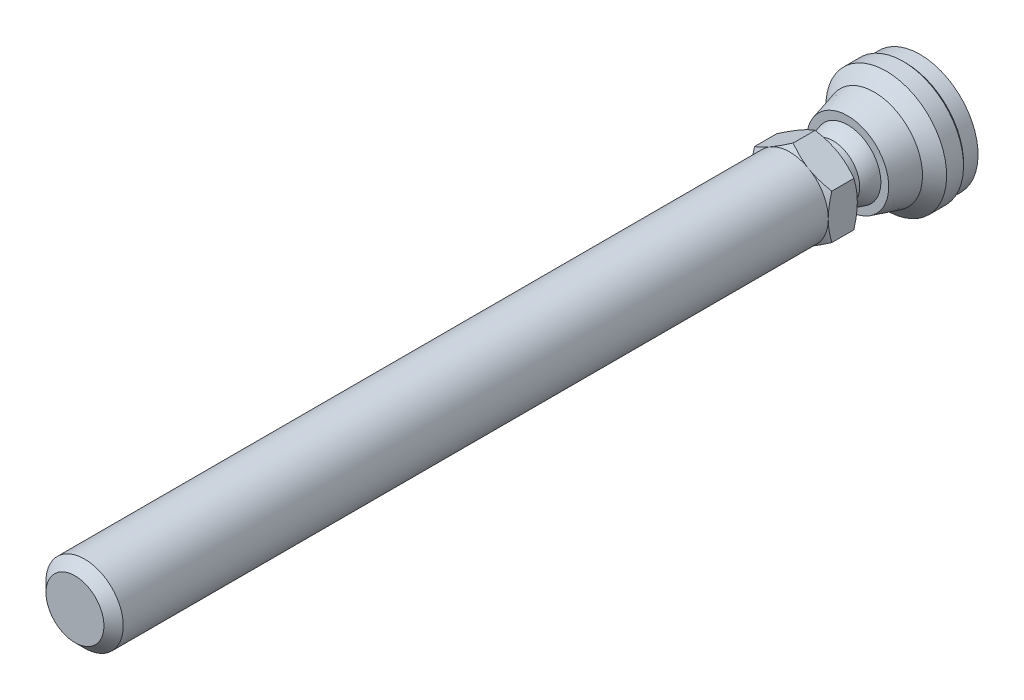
ISO-10303-21;
HEADER;
FILE_DESCRIPTION(('STEP AP214'),'2;1');
FILE_NAME('part.step','',(''),(''),'','','');
FILE_SCHEMA(('AUTOMOTIVE_DESIGN { 1 0 10303 214 1 1 1 1 }'));
ENDSEC;
DATA;
#1=APPLICATION_CONTEXT('core data for automotive mechanical design processes');
#2=APPLICATION_PROTOCOL_DEFINITION('international standard','automotive_design',2000,#1);
#3=PRODUCT_CONTEXT('',#1,'mechanical');
#4=PRODUCT('Part','Part','',(#3));
#5=PRODUCT_RELATED_PRODUCT_CATEGORY('part','',(#4));
#6=PRODUCT_DEFINITION_FORMATION('','',#4);
#7=PRODUCT_DEFINITION_CONTEXT('part definition',#1,'design');
#8=PRODUCT_DEFINITION('design','',#6,#7);
#9=PRODUCT_DEFINITION_SHAPE('','',#8);
#10=(LENGTH_UNIT() NAMED_UNIT(*) SI_UNIT(.MILLI.,.METRE.));
#11=(NAMED_UNIT(*) PLANE_ANGLE_UNIT() SI_UNIT($,.RADIAN.));
#12=(NAMED_UNIT(*) SI_UNIT($,.STERADIAN.) SOLID_ANGLE_UNIT());
#13=UNCERTAINTY_MEASURE_WITH_UNIT(LENGTH_MEASURE(1.E-05),#10,'distance_accuracy_value','');
#14=(GEOMETRIC_REPRESENTATION_CONTEXT(3) GLOBAL_UNCERTAINTY_ASSIGNED_CONTEXT((#13)) GLOBAL_UNIT_ASSIGNED_CONTEXT((#10,
#11,#12)) REPRESENTATION_CONTEXT('',''));
#15=CARTESIAN_POINT('',(0.,0.,0.));
#16=DIRECTION('',(0.,0.,1.));
#17=DIRECTION('',(1.,0.,0.));
#18=AXIS2_PLACEMENT_3D('',#15,#16,#17);
#19=CARTESIAN_POINT('',(-7.7647058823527,0.,20.9999999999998));
#20=DIRECTION('',(0.,0.,1.));
#21=DIRECTION('',(0.,-1.,0.));
#22=AXIS2_PLACEMENT_3D('',#19,#20,#21);
#23=PLANE('',#22);
#24=CARTESIAN_POINT('',(0.,0.,20.9999999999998));
#25=DIRECTION('',(0.,0.,-1.));
#26=DIRECTION('',(0.,1.,0.));
#27=AXIS2_PLACEMENT_3D('',#24,#25,#26);
#28=CIRCLE('',#27,5.49999999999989);
#29=CARTESIAN_POINT('',(0.,5.49999999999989,20.9999999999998));
#30=VERTEX_POINT('',#29);
#31=EDGE_CURVE('E293',#30,#30,#28,.T.);
#32=ORIENTED_EDGE('',*,*,#31,.F.);
#33=EDGE_LOOP('',(#32));
#34=FACE_BOUND('',#33,.T.);
#35=CARTESIAN_POINT('',(0.,0.,20.9999999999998));
#36=DIRECTION('',(0.,0.,1.));
#37=DIRECTION('',(0.,-1.,0.));
#38=AXIS2_PLACEMENT_3D('',#35,#36,#37);
#39=CIRCLE('',#38,7.99999999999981);
#40=CARTESIAN_POINT('',(-4.,-6.92820323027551,20.9999999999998));
#41=VERTEX_POINT('',#40);
#42=CARTESIAN_POINT('',(4.,-6.92820323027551,20.9999999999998));
#43=VERTEX_POINT('',#42);
#44=EDGE_CURVE('E106',#41,#43,#39,.T.);
#45=ORIENTED_EDGE('',*,*,#44,.F.);
#46=CARTESIAN_POINT('',(-8.,0.,20.9999999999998));
#47=VERTEX_POINT('',#46);
#48=EDGE_CURVE('E117',#47,#41,#39,.T.);
#49=ORIENTED_EDGE('',*,*,#48,.F.);
#50=CARTESIAN_POINT('',(-4.,6.92820323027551,20.9999999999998));
#51=VERTEX_POINT('',#50);
#52=EDGE_CURVE('E416',#51,#47,#39,.T.);
#53=ORIENTED_EDGE('',*,*,#52,.F.);
#54=CARTESIAN_POINT('',(4.,6.92820323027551,20.9999999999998));
#55=VERTEX_POINT('',#54);
#56=EDGE_CURVE('E34',#55,#51,#39,.T.);
#57=ORIENTED_EDGE('',*,*,#56,.F.);
#58=CARTESIAN_POINT('',(8.,0.,20.9999999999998));
#59=VERTEX_POINT('',#58);
#60=EDGE_CURVE('E140',#59,#55,#39,.T.);
#61=ORIENTED_EDGE('',*,*,#60,.F.);
#62=EDGE_CURVE('E119',#43,#59,#39,.T.);
#63=ORIENTED_EDGE('',*,*,#62,.F.);
#64=EDGE_LOOP('',(#45,#49,#53,#57,#61,#63));
#65=FACE_BOUND('',#64,.T.);
#66=ADVANCED_FACE('F14',(#34,#65),#23,.F.);
#67=CARTESIAN_POINT('',(0.,0.,0.));
#68=DIRECTION('',(0.,0.,-1.));
#69=DIRECTION('',(0.,1.,0.));
#70=AXIS2_PLACEMENT_3D('',#67,#68,#69);
#71=CYLINDRICAL_SURFACE('',#70,5.4999999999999);
#72=CARTESIAN_POINT('',(0.,0.,18.));
#73=DIRECTION('',(0.,0.,-1.));
#74=DIRECTION('',(0.,1.,0.));
#75=AXIS2_PLACEMENT_3D('',#72,#73,#74);
#76=CIRCLE('',#75,5.4999999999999);
#77=CARTESIAN_POINT('',(-5.49999999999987,0.,18.));
#78=VERTEX_POINT('',#77);
#79=EDGE_CURVE('E298',#78,#78,#76,.T.);
#80=ORIENTED_EDGE('',*,*,#79,.F.);
#81=EDGE_LOOP('',(#80));
#82=FACE_BOUND('',#81,.T.);
#83=ORIENTED_EDGE('',*,*,#31,.T.);
#84=EDGE_LOOP('',(#83));
#85=FACE_BOUND('',#84,.T.);
#86=ADVANCED_FACE('F259',(#82,#85),#71,.T.);
#87=CARTESIAN_POINT('',(1.11022302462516E-13,0.,13.6698729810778));
#88=DIRECTION('',(0.,0.,-1.));
#89=DIRECTION('',(-1.,0.,0.));
#90=AXIS2_PLACEMENT_3D('',#87,#88,#89);
#91=SPHERICAL_SURFACE('',#90,7.);
#92=CARTESIAN_POINT('',(0.,0.,15.));
#93=DIRECTION('',(0.,0.,-1.));
#94=DIRECTION('',(0.,1.,0.));
#95=AXIS2_PLACEMENT_3D('',#92,#93,#94);
#96=CIRCLE('',#95,6.87246404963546);
#97=CARTESIAN_POINT('',(-6.87246404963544,0.,15.));
#98=VERTEX_POINT('',#97);
#99=EDGE_CURVE('E301',#98,#98,#96,.T.);
#100=CARTESIAN_POINT('',(-6.87246404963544,0.,15.));
#101=CARTESIAN_POINT('',(-6.86587210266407,0.,15.0340591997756));
#102=CARTESIAN_POINT('',(-6.85902692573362,0.,15.0680693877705));
#103=CARTESIAN_POINT('',(-6.84483171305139,0.,15.1359842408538));
#104=CARTESIAN_POINT('',(-6.83748167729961,0.,15.1698889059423));
#105=CARTESIAN_POINT('',(-6.82227834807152,0.,15.2375852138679));
#106=CARTESIAN_POINT('',(-6.81442505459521,0.,15.2713768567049));
#107=CARTESIAN_POINT('',(-6.79821695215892,0.,15.3388396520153));
#108=CARTESIAN_POINT('',(-6.78986214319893,0.,15.3725108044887));
#109=CARTESIAN_POINT('',(-6.77265285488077,0.,15.4397251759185));
#110=CARTESIAN_POINT('',(-6.7637983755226,0.,15.473268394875));
#111=CARTESIAN_POINT('',(-6.74559170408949,0.,15.5402194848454));
#112=CARTESIAN_POINT('',(-6.73623951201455,0.,15.5736273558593));
#113=CARTESIAN_POINT('',(-6.71703948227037,0.,15.6403003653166));
#114=CARTESIAN_POINT('',(-6.70719164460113,0.,15.67356550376));
#115=CARTESIAN_POINT('',(-6.68700250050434,0.,15.7399456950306));
#116=CARTESIAN_POINT('',(-6.67666119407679,0.,15.7730607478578));
#117=CARTESIAN_POINT('',(-6.65548739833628,0.,15.8391334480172));
#118=CARTESIAN_POINT('',(-6.64465490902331,0.,15.8720910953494));
#119=CARTESIAN_POINT('',(-6.62250114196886,0.,15.9378416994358));
#120=CARTESIAN_POINT('',(-6.61117986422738,0.,15.9706346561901));
#121=CARTESIAN_POINT('',(-6.58805102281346,0.,16.0360486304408));
#122=CARTESIAN_POINT('',(-6.57624345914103,0.,16.0686696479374));
#123=CARTESIAN_POINT('',(-6.55214465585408,0.,16.1337325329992));
#124=CARTESIAN_POINT('',(-6.53985341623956,0.,16.1661744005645));
#125=CARTESIAN_POINT('',(-6.51478997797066,0.,16.2308718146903));
#126=CARTESIAN_POINT('',(-6.50201777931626,0.,16.2631273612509));
#127=CARTESIAN_POINT('',(-6.47599524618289,0.,16.3274450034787));
#128=CARTESIAN_POINT('',(-6.4627449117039,0.,16.3595070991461));
#129=CARTESIAN_POINT('',(-6.43576903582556,0.,16.4234307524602));
#130=CARTESIAN_POINT('',(-6.42204349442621,0.,16.455292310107));
#131=CARTESIAN_POINT('',(-6.39412023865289,0.,16.5188078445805));
#132=CARTESIAN_POINT('',(-6.37992252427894,0.,16.5504618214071));
#133=CARTESIAN_POINT('',(-6.3510580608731,0.,16.6135551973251));
#134=CARTESIAN_POINT('',(-6.33639131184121,0.,16.6449945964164));
#135=CARTESIAN_POINT('',(-6.30659202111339,0.,16.7076518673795));
#136=CARTESIAN_POINT('',(-6.29145947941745,0.,16.7388697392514));
#137=CARTESIAN_POINT('',(-6.26073194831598,0.,16.8010770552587));
#138=CARTESIAN_POINT('',(-6.24513695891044,0.,16.8320664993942));
#139=CARTESIAN_POINT('',(-6.21348797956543,0.,16.8938101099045));
#140=CARTESIAN_POINT('',(-6.19743398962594,0.,16.9245642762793));
#141=CARTESIAN_POINT('',(-6.1648705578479,0.,16.9858305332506));
#142=CARTESIAN_POINT('',(-6.14836111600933,0.,17.016342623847));
#143=CARTESIAN_POINT('',(-6.11489042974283,0.,17.0771179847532));
#144=CARTESIAN_POINT('',(-6.09792918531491,0.,17.107381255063));
#145=CARTESIAN_POINT('',(-6.0635586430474,0.,17.1676522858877));
#146=CARTESIAN_POINT('',(-6.04614934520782,0.,17.1976600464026));
#147=CARTESIAN_POINT('',(-6.0108865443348,0.,17.2574134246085));
#148=CARTESIAN_POINT('',(-5.99303304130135,0.,17.2871590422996));
#149=CARTESIAN_POINT('',(-5.95688577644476,0.,17.3463815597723));
#150=CARTESIAN_POINT('',(-5.93859201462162,0.,17.3758584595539));
#151=CARTESIAN_POINT('',(-5.90156827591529,0.,17.4345370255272));
#152=CARTESIAN_POINT('',(-5.8828382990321,0.,17.4637386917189));
#153=CARTESIAN_POINT('',(-5.84494627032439,0.,17.5218603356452));
#154=CARTESIAN_POINT('',(-5.82578421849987,0.,17.5507803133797));
#155=CARTESIAN_POINT('',(-5.78703227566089,0.,17.6083321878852));
#156=CARTESIAN_POINT('',(-5.76744238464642,0.,17.6369640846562));
#157=CARTESIAN_POINT('',(-5.72783909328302,0.,17.6939334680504));
#158=CARTESIAN_POINT('',(-5.70782569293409,0.,17.7222709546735));
#159=CARTESIAN_POINT('',(-5.66737980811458,0.,17.778645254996));
#160=CARTESIAN_POINT('',(-5.64694732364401,0.,17.8066820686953));
#161=CARTESIAN_POINT('',(-5.60566778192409,0.,17.862448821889));
#162=CARTESIAN_POINT('',(-5.58482072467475,0.,17.8901787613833));
#163=CARTESIAN_POINT('',(-5.54271666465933,0.,17.9453256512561));
#164=CARTESIAN_POINT('',(-5.52145966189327,0.,17.9727426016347));
#165=CARTESIAN_POINT('',(-5.49999999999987,0.,18.));
#166=B_SPLINE_CURVE_WITH_KNOTS('',3,(#100,#101,#102,#103,#104,#105,#106,#107,#108,#109,#110,
#111,#112,#113,#114,#115,#116,#117,#118,#119,#120,#121,#122,#123,#124,#125,#126,#127,#128,#129,
#130,#131,#132,#133,#134,#135,#136,#137,#138,#139,#140,#141,#142,#143,#144,#145,#146,#147,#148,
#149,#150,#151,#152,#153,#154,#155,#156,#157,#158,#159,#160,#161,#162,#163,#164,#165),
.UNSPECIFIED.,.F.,.F.,(4,2,2,2,2,2,2,2,2,2,2,2,2,2,2,2,2,2,2,2,2,2,2,2,2,2,2,2,2,2,2,2,4),(0.,
0.104072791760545,0.208145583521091,0.312218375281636,0.416291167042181,0.520363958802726,
0.624436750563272,0.728509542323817,0.832582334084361,0.93665512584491,1.04072791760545,
1.144800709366,1.24887350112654,1.35294629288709,1.45701908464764,1.56109187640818,
1.66516466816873,1.76923745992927,1.87331025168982,1.97738304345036,2.08145583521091,
2.18552862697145,2.289601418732,2.39367421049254,2.49774700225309,2.60181979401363,
2.70589258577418,2.80996537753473,2.91403816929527,3.01811096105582,3.12218375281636,
3.22625654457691,3.33032933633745),.UNSPECIFIED.);
#167=EDGE_CURVE('BSEAM255',#98,#78,#166,.T.);
#168=ORIENTED_EDGE('',*,*,#99,.F.);
#169=ORIENTED_EDGE('',*,*,#79,.T.);
#170=ORIENTED_EDGE('',*,*,#167,.T.);
#171=ORIENTED_EDGE('',*,*,#167,.F.);
#172=EDGE_LOOP('',(#168,#170,#169,#171));
#173=FACE_BOUND('',#172,.T.);
#174=ADVANCED_FACE('F255',(#173),#91,.T.);
#175=CARTESIAN_POINT('',(-8.5,0.,15.));
#176=DIRECTION('',(0.,0.,-1.));
#177=DIRECTION('',(0.,1.,0.));
#178=AXIS2_PLACEMENT_3D('',#175,#176,#177);
#179=PLANE('',#178);
#180=CARTESIAN_POINT('',(0.,0.,15.));
#181=DIRECTION('',(0.,0.,-1.));
#182=DIRECTION('',(0.,1.,0.));
#183=AXIS2_PLACEMENT_3D('',#180,#181,#182);
#184=CIRCLE('',#183,8.5);
#185=CARTESIAN_POINT('',(0.,8.5,15.));
#186=VERTEX_POINT('',#185);
#187=EDGE_CURVE('E304',#186,#186,#184,.T.);
#188=ORIENTED_EDGE('',*,*,#187,.F.);
#189=EDGE_LOOP('',(#188));
#190=FACE_BOUND('',#189,.T.);
#191=ORIENTED_EDGE('',*,*,#99,.T.);
#192=EDGE_LOOP('',(#191));
#193=FACE_BOUND('',#192,.T.);
#194=ADVANCED_FACE('F251',(#190,#193),#179,.F.);
#195=CARTESIAN_POINT('',(0.,0.,15.));
#196=DIRECTION('',(0.,0.,-1.));
#197=DIRECTION('',(0.,1.,0.));
#198=AXIS2_PLACEMENT_3D('',#195,#196,#197);
#199=CONICAL_SURFACE('',#198,8.5,0.266252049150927);
#200=CARTESIAN_POINT('',(0.,0.,9.5));
#201=DIRECTION('',(0.,0.,-1.));
#202=DIRECTION('',(0.,1.,0.));
#203=AXIS2_PLACEMENT_3D('',#200,#201,#202);
#204=CIRCLE('',#203,10.);
#205=CARTESIAN_POINT('',(0.,10.,9.5));
#206=VERTEX_POINT('',#205);
#207=EDGE_CURVE('E307',#206,#206,#204,.T.);
#208=ORIENTED_EDGE('',*,*,#207,.F.);
#209=EDGE_LOOP('',(#208));
#210=FACE_BOUND('',#209,.T.);
#211=ORIENTED_EDGE('',*,*,#187,.T.);
#212=EDGE_LOOP('',(#211));
#213=FACE_BOUND('',#212,.T.);
#214=ADVANCED_FACE('F247',(#210,#213),#199,.T.);
#215=CARTESIAN_POINT('',(0.,0.,9.5));
#216=DIRECTION('',(0.,0.,-1.));
#217=DIRECTION('',(0.,1.,0.));
#218=AXIS2_PLACEMENT_3D('',#215,#216,#217);
#219=CONICAL_SURFACE('',#218,10.,0.785398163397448);
#220=CARTESIAN_POINT('',(0.,0.,7.));
#221=DIRECTION('',(0.,0.,-1.));
#222=DIRECTION('',(0.,1.,0.));
#223=AXIS2_PLACEMENT_3D('',#220,#221,#222);
#224=CIRCLE('',#223,12.5);
#225=CARTESIAN_POINT('',(0.,12.5,7.));
#226=VERTEX_POINT('',#225);
#227=EDGE_CURVE('E310',#226,#226,#224,.T.);
#228=ORIENTED_EDGE('',*,*,#227,.F.);
#229=EDGE_LOOP('',(#228));
#230=FACE_BOUND('',#229,.T.);
#231=ORIENTED_EDGE('',*,*,#207,.T.);
#232=EDGE_LOOP('',(#231));
#233=FACE_BOUND('',#232,.T.);
#234=ADVANCED_FACE('F243',(#230,#233),#219,.T.);
#235=CARTESIAN_POINT('',(0.,0.,0.));
#236=DIRECTION('',(0.,0.,-1.));
#237=DIRECTION('',(0.,1.,0.));
#238=AXIS2_PLACEMENT_3D('',#235,#236,#237);
#239=CYLINDRICAL_SURFACE('',#238,12.5);
#240=CARTESIAN_POINT('',(0.,0.,3.5));
#241=DIRECTION('',(0.,0.,-1.));
#242=DIRECTION('',(0.,1.,0.));
#243=AXIS2_PLACEMENT_3D('',#240,#241,#242);
#244=CIRCLE('',#243,12.5);
#245=CARTESIAN_POINT('',(0.,12.5,3.5));
#246=VERTEX_POINT('',#245);
#247=EDGE_CURVE('E313',#246,#246,#244,.T.);
#248=ORIENTED_EDGE('',*,*,#247,.F.);
#249=EDGE_LOOP('',(#248));
#250=FACE_BOUND('',#249,.T.);
#251=ORIENTED_EDGE('',*,*,#227,.T.);
#252=EDGE_LOOP('',(#251));
#253=FACE_BOUND('',#252,.T.);
#254=ADVANCED_FACE('F239',(#250,#253),#239,.T.);
#255=CARTESIAN_POINT('',(0.,0.,3.5));
#256=DIRECTION('',(0.,0.,1.));
#257=DIRECTION('',(0.,-1.,0.));
#258=AXIS2_PLACEMENT_3D('',#255,#256,#257);
#259=CONICAL_SURFACE('',#258,12.5,0.785398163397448);
#260=CARTESIAN_POINT('',(0.,0.,3.));
#261=DIRECTION('',(0.,0.,-1.));
#262=DIRECTION('',(0.,1.,0.));
#263=AXIS2_PLACEMENT_3D('',#260,#261,#262);
#264=CIRCLE('',#263,12.);
#265=CARTESIAN_POINT('',(0.,12.,3.));
#266=VERTEX_POINT('',#265);
#267=EDGE_CURVE('E316',#266,#266,#264,.T.);
#268=ORIENTED_EDGE('',*,*,#267,.F.);
#269=EDGE_LOOP('',(#268));
#270=FACE_BOUND('',#269,.T.);
#271=ORIENTED_EDGE('',*,*,#247,.T.);
#272=EDGE_LOOP('',(#271));
#273=FACE_BOUND('',#272,.T.);
#274=ADVANCED_FACE('F235',(#270,#273),#259,.T.);
#275=CARTESIAN_POINT('',(0.,0.,0.));
#276=DIRECTION('',(0.,0.,-1.));
#277=DIRECTION('',(0.,1.,0.));
#278=AXIS2_PLACEMENT_3D('',#275,#276,#277);
#279=CYLINDRICAL_SURFACE('',#278,12.);
#280=CARTESIAN_POINT('',(0.,0.,0.));
#281=DIRECTION('',(0.,0.,-1.));
#282=DIRECTION('',(0.,1.,0.));
#283=AXIS2_PLACEMENT_3D('',#280,#281,#282);
#284=CIRCLE('',#283,12.);
#285=CARTESIAN_POINT('',(0.,12.,0.));
#286=VERTEX_POINT('',#285);
#287=EDGE_CURVE('E319',#286,#286,#284,.T.);
#288=ORIENTED_EDGE('',*,*,#287,.F.);
#289=EDGE_LOOP('',(#288));
#290=FACE_BOUND('',#289,.T.);
#291=ORIENTED_EDGE('',*,*,#267,.T.);
#292=EDGE_LOOP('',(#291));
#293=FACE_BOUND('',#292,.T.);
#294=ADVANCED_FACE('F231',(#290,#293),#279,.T.);
#295=CARTESIAN_POINT('',(-12.,0.,0.));
#296=DIRECTION('',(0.,0.,1.));
#297=DIRECTION('',(0.,-1.,0.));
#298=AXIS2_PLACEMENT_3D('',#295,#296,#297);
#299=PLANE('',#298);
#300=ORIENTED_EDGE('',*,*,#287,.T.);
#301=EDGE_LOOP('',(#300));
#302=FACE_BOUND('',#301,.T.);
#303=ADVANCED_FACE('F163',(#302),#299,.F.);
#304=CARTESIAN_POINT('',(0.,0.,20.9999999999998));
#305=DIRECTION('',(0.,0.,1.));
#306=DIRECTION('',(0.,-1.,0.));
#307=AXIS2_PLACEMENT_3D('',#304,#305,#306);
#308=CONICAL_SURFACE('',#307,7.99999999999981,1.0471975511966);
#309=CARTESIAN_POINT('',(8.,12.4182643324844,24.9098415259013));
#310=CARTESIAN_POINT('',(8.,12.0687618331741,24.7402548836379));
#311=CARTESIAN_POINT('',(8.,11.7184582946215,24.5722909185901));
#312=CARTESIAN_POINT('',(8.,11.015823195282,24.2405207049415));
#313=CARTESIAN_POINT('',(8.,10.6634913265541,24.0767151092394));
#314=CARTESIAN_POINT('',(8.,9.95456379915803,23.7533523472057));
#315=CARTESIAN_POINT('',(8.,9.59795537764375,23.593823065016));
#316=CARTESIAN_POINT('',(8.,8.88190640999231,23.2812772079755));
#317=CARTESIAN_POINT('',(8.,8.5224659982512,23.1282603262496));
#318=CARTESIAN_POINT('',(8.,7.78851841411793,22.8256496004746));
#319=CARTESIAN_POINT('',(8.,7.41389936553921,22.6763256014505));
#320=CARTESIAN_POINT('',(8.,6.66028362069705,22.3889508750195));
#321=CARTESIAN_POINT('',(8.,6.28128643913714,22.2509014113));
#322=CARTESIAN_POINT('',(8.,5.51901257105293,21.9896918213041));
#323=CARTESIAN_POINT('',(8.,5.13574629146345,21.8665016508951));
#324=CARTESIAN_POINT('',(8.,4.36372954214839,21.6389544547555));
#325=CARTESIAN_POINT('',(8.,3.97498083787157,21.5345915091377));
#326=CARTESIAN_POINT('',(8.,3.19388284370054,21.3502643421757));
#327=CARTESIAN_POINT('',(8.,2.80156587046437,21.2701668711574));
#328=CARTESIAN_POINT('',(8.,2.20950844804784,21.1716794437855));
#329=CARTESIAN_POINT('',(8.,2.01154448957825,21.1424587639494));
#330=CARTESIAN_POINT('',(8.,1.61462864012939,21.0918098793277));
#331=CARTESIAN_POINT('',(8.,1.41567684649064,21.0703809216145));
#332=CARTESIAN_POINT('',(8.,1.01965570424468,21.036011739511));
#333=CARTESIAN_POINT('',(8.,0.822595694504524,21.0229643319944));
#334=CARTESIAN_POINT('',(8.,0.428100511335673,21.0052150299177));
#335=CARTESIAN_POINT('',(8.,0.230665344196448,21.0005129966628));
#336=CARTESIAN_POINT('',(8.,-0.164226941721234,20.9995666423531));
#337=CARTESIAN_POINT('',(8.,-0.361684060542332,21.0033223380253));
#338=CARTESIAN_POINT('',(8.,-0.756264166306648,21.0191994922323));
#339=CARTESIAN_POINT('',(8.,-0.953387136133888,21.0313213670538));
#340=CARTESIAN_POINT('',(8.,-1.42679253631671,21.0702223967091));
#341=CARTESIAN_POINT('',(8.,-1.70275721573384,21.1009521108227));
#342=CARTESIAN_POINT('',(8.,-2.25263292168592,21.1771343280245));
#343=CARTESIAN_POINT('',(8.,-2.52654366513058,21.2225888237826));
#344=CARTESIAN_POINT('',(8.,-3.34488585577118,21.3786288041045));
#345=CARTESIAN_POINT('',(8.,-3.88562014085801,21.5088622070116));
#346=CARTESIAN_POINT('',(8.,-4.69415092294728,21.7346299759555));
#347=CARTESIAN_POINT('',(8.,-4.96614331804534,21.8160015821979));
#348=CARTESIAN_POINT('',(8.,-5.50748639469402,21.9871809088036));
#349=CARTESIAN_POINT('',(8.,-5.77683705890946,22.0769886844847));
#350=CARTESIAN_POINT('',(8.,-6.31298139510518,22.2636007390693));
#351=CARTESIAN_POINT('',(8.,-6.57977588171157,22.360402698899));
#352=CARTESIAN_POINT('',(8.,-7.11115573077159,22.5598657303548));
#353=CARTESIAN_POINT('',(8.,-7.37574111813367,22.6625267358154));
#354=CARTESIAN_POINT('',(8.,-7.99604831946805,22.9098563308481));
#355=CARTESIAN_POINT('',(8.,-8.3509583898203,23.0565569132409));
#356=CARTESIAN_POINT('',(8.,-9.05778498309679,23.3570212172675));
#357=CARTESIAN_POINT('',(8.,-9.4097013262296,23.510785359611));
#358=CARTESIAN_POINT('',(8.,-10.1110920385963,23.8239742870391));
#359=CARTESIAN_POINT('',(8.,-10.460565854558,23.9834003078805));
#360=CARTESIAN_POINT('',(8.,-11.1573980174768,24.3067808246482));
#361=CARTESIAN_POINT('',(8.,-11.5047564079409,24.4707352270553));
#362=CARTESIAN_POINT('',(8.,-12.1980792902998,24.8025096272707));
#363=CARTESIAN_POINT('',(8.,-12.5440418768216,24.9703336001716));
#364=CARTESIAN_POINT('',(8.,-13.2344755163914,25.3090249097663));
#365=CARTESIAN_POINT('',(8.,-13.5789465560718,25.4798922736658));
#366=CARTESIAN_POINT('',(8.,-14.6103855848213,25.9962109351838));
#367=CARTESIAN_POINT('',(8.,-15.2954708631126,26.3454228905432));
#368=CARTESIAN_POINT('',(8.,-16.6052534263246,27.0216282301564));
#369=CARTESIAN_POINT('',(8.,-17.2302423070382,27.3480593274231));
#370=CARTESIAN_POINT('',(8.,-18.4778803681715,28.0054114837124));
#371=CARTESIAN_POINT('',(7.99999999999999,-19.1005294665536,28.3363326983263));
#372=CARTESIAN_POINT('',(7.99999999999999,-20.3424616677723,29.0007759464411));
#373=CARTESIAN_POINT('',(7.99999999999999,-20.9617492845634,29.3342895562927));
#374=CARTESIAN_POINT('',(7.99999999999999,-22.1988258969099,30.0040053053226));
#375=CARTESIAN_POINT('',(8.,-22.816614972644,30.3402072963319));
#376=CARTESIAN_POINT('',(8.,-23.4338513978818,30.6774140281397));
#377=B_SPLINE_CURVE_WITH_KNOTS('',3,(#309,#310,#311,#312,#313,#314,#315,#316,#317,#318,#319,
#320,#321,#322,#323,#324,#325,#326,#327,#328,#329,#330,#331,#332,#333,#334,#335,#336,#337,#338,
#339,#340,#341,#342,#343,#344,#345,#346,#347,#348,#349,#350,#351,#352,#353,#354,#355,#356,#357,
#358,#359,#360,#361,#362,#363,#364,#365,#366,#367,#368,#369,#370,#371,#372,#373,#374,#375,#376),
.UNSPECIFIED.,.F.,.F.,(4,2,2,2,2,2,2,2,2,2,2,2,2,2,2,2,2,2,2,2,2,2,2,2,2,2,2,2,2,2,2,2,2,4),(0.,
1.16543453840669,2.3310509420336,3.50299381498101,4.67488140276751,5.8845892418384,
7.09443248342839,8.30178700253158,9.50876122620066,10.7089821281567,11.3091796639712,
11.9093191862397,12.5016227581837,13.09391648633,13.6862113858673,14.2785357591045,
15.1110765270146,15.9437300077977,17.6099581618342,18.4615977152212,19.3132428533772,
20.1646068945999,21.0159613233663,22.1679611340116,23.3200296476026,24.4723511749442,
25.6246489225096,26.7781883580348,27.9317381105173,30.2385332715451,32.3538188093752,
34.4691778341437,36.5793215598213,38.6893497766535),.UNSPECIFIED.);
#378=CARTESIAN_POINT('',(8.,4.61880215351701,21.7145311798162));
#379=VERTEX_POINT('',#378);
#380=EDGE_CURVE('E141',#379,#59,#377,.T.);
#381=ORIENTED_EDGE('',*,*,#380,.T.);
#382=ORIENTED_EDGE('',*,*,#60,.T.);
#383=CARTESIAN_POINT('',(-0.000199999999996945,9.23771977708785,21.7145978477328));
#384=CARTESIAN_POINT('',(0.175648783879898,9.13619343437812,21.6559907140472));
#385=CARTESIAN_POINT('',(0.352153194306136,9.03428856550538,21.6000434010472));
#386=CARTESIAN_POINT('',(0.706595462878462,8.82965122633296,21.4942010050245));
#387=CARTESIAN_POINT('',(0.884533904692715,8.72691841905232,21.4443085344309));
#388=CARTESIAN_POINT('',(1.42119823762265,8.41707512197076,21.3046927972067));
#389=CARTESIAN_POINT('',(1.78204258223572,8.20874154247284,21.2252811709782));
#390=CARTESIAN_POINT('',(2.32203917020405,7.89697436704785,21.1321616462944));
#391=CARTESIAN_POINT('',(2.49957818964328,7.79447216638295,21.105634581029));
#392=CARTESIAN_POINT('',(2.8554591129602,7.58900421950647,21.0611531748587));
#393=CARTESIAN_POINT('',(3.03380094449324,7.4860385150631,21.0431980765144));
#394=CARTESIAN_POINT('',(3.39079168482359,7.27992981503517,21.0163156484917));
#395=CARTESIAN_POINT('',(3.5694400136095,7.17678715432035,21.0073780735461));
#396=CARTESIAN_POINT('',(3.92690170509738,6.97040655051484,20.998722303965));
#397=CARTESIAN_POINT('',(4.10571506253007,6.86716861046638,20.9990038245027));
#398=CARTESIAN_POINT('',(4.44001336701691,6.67416139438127,21.0081450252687));
#399=CARTESIAN_POINT('',(4.59552190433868,6.58437849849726,21.0158896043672));
#400=CARTESIAN_POINT('',(4.90617476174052,6.40502298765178,21.0382011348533));
#401=CARTESIAN_POINT('',(5.06131905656,6.31545038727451,21.052768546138));
#402=CARTESIAN_POINT('',(5.52615131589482,6.04707935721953,21.1063606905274));
#403=CARTESIAN_POINT('',(5.83501648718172,5.86875596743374,21.155268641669));
#404=CARTESIAN_POINT('',(6.4560232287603,5.51021755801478,21.2775394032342));
#405=CARTESIAN_POINT('',(6.76808554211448,5.33004829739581,21.3514205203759));
#406=CARTESIAN_POINT('',(7.38755648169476,4.97239658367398,21.5191001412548));
#407=CARTESIAN_POINT('',(7.69497304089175,4.79490955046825,21.6128592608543));
#408=CARTESIAN_POINT('',(8.0002,4.61868668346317,21.7145978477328));
#409=B_SPLINE_CURVE_WITH_KNOTS('',3,(#383,#384,#385,#386,#387,#388,#389,#390,#391,#392,#393,
#394,#395,#396,#397,#398,#399,#400,#401,#402,#403,#404,#405,#406,#407,#408),.UNSPECIFIED.,.F.,
.F.,(4,2,2,2,2,2,2,2,2,2,2,2,4),(0.,0.633973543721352,1.26821965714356,2.53934712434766,
3.15934343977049,3.77928496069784,4.39852133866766,5.01773858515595,5.55680239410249,
6.09590254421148,7.17487077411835,8.27776850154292,9.37850115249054),.UNSPECIFIED.);
#410=EDGE_CURVE('E18',#55,#379,#409,.T.);
#411=ORIENTED_EDGE('',*,*,#410,.T.);
#412=EDGE_LOOP('',(#381,#382,#411));
#413=FACE_BOUND('',#412,.T.);
#414=ADVANCED_FACE('F158',(#413),#308,.T.);
#415=CARTESIAN_POINT('',(-8.0002,4.61868668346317,21.7145978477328));
#416=CARTESIAN_POINT('',(-7.82435121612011,4.7202130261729,21.6559907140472));
#417=CARTESIAN_POINT('',(-7.64784680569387,4.82211789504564,21.6000434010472));
#418=CARTESIAN_POINT('',(-7.29340453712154,5.02675523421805,21.4942010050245));
#419=CARTESIAN_POINT('',(-7.11546609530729,5.1294880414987,21.4443085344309));
#420=CARTESIAN_POINT('',(-6.57880176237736,5.43933133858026,21.3046927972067));
#421=CARTESIAN_POINT('',(-6.21795741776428,5.64766491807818,21.2252811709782));
#422=CARTESIAN_POINT('',(-5.67796082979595,5.95943209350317,21.1321616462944));
#423=CARTESIAN_POINT('',(-5.50042181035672,6.06193429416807,21.105634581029));
#424=CARTESIAN_POINT('',(-5.14454088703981,6.26740224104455,21.0611531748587));
#425=CARTESIAN_POINT('',(-4.96619905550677,6.37036794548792,21.0431980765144));
#426=CARTESIAN_POINT('',(-4.60920831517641,6.57647664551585,21.0163156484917));
#427=CARTESIAN_POINT('',(-4.4305599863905,6.67961930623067,21.0073780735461));
#428=CARTESIAN_POINT('',(-4.07309829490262,6.88599991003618,20.998722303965));
#429=CARTESIAN_POINT('',(-3.89428493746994,6.98923785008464,20.9990038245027));
#430=CARTESIAN_POINT('',(-3.5599866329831,7.18224506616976,21.0081450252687));
#431=CARTESIAN_POINT('',(-3.40447809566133,7.27202796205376,21.0158896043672));
#432=CARTESIAN_POINT('',(-3.09382523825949,7.45138347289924,21.0382011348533));
#433=CARTESIAN_POINT('',(-2.93868094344,7.54095607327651,21.052768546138));
#434=CARTESIAN_POINT('',(-2.47384868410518,7.80932710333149,21.1063606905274));
#435=CARTESIAN_POINT('',(-2.16498351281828,7.98765049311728,21.155268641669));
#436=CARTESIAN_POINT('',(-1.5439767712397,8.34618890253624,21.2775394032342));
#437=CARTESIAN_POINT('',(-1.23191445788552,8.52635816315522,21.3514205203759));
#438=CARTESIAN_POINT('',(-0.612443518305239,8.88400987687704,21.5191001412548));
#439=CARTESIAN_POINT('',(-0.305026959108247,9.06149691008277,21.6128592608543));
#440=CARTESIAN_POINT('',(0.000200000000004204,9.23771977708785,21.7145978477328));
#441=B_SPLINE_CURVE_WITH_KNOTS('',3,(#415,#416,#417,#418,#419,#420,#421,#422,#423,#424,#425,
#426,#427,#428,#429,#430,#431,#432,#433,#434,#435,#436,#437,#438,#439,#440),.UNSPECIFIED.,.F.,
.F.,(4,2,2,2,2,2,2,2,2,2,2,2,4),(0.,0.633973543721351,1.26821965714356,2.53934712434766,
3.15934343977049,3.77928496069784,4.39852133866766,5.01773858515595,5.55680239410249,
6.09590254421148,7.17487077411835,8.27776850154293,9.37850115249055),.UNSPECIFIED.);
#442=CARTESIAN_POINT('',(0.,9.23760430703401,21.7145311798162));
#443=VERTEX_POINT('',#442);
#444=EDGE_CURVE('E142',#51,#443,#441,.T.);
#445=ORIENTED_EDGE('',*,*,#444,.T.);
#446=EDGE_CURVE('E9',#443,#55,#409,.T.);
#447=ORIENTED_EDGE('',*,*,#446,.T.);
#448=ORIENTED_EDGE('',*,*,#56,.T.);
#449=EDGE_LOOP('',(#445,#447,#448));
#450=FACE_BOUND('',#449,.T.);
#451=ADVANCED_FACE('F162',(#450),#308,.T.);
#452=CARTESIAN_POINT('',(8.0002,-4.61868668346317,21.7145978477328));
#453=CARTESIAN_POINT('',(7.82435121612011,-4.7202130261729,21.6559907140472));
#454=CARTESIAN_POINT('',(7.64784680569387,-4.82211789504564,21.6000434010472));
#455=CARTESIAN_POINT('',(7.29340453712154,-5.02675523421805,21.4942010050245));
#456=CARTESIAN_POINT('',(7.11546609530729,-5.1294880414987,21.4443085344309));
#457=CARTESIAN_POINT('',(6.57880176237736,-5.43933133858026,21.3046927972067));
#458=CARTESIAN_POINT('',(6.21795741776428,-5.64766491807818,21.2252811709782));
#459=CARTESIAN_POINT('',(5.67796082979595,-5.95943209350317,21.1321616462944));
#460=CARTESIAN_POINT('',(5.50042181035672,-6.06193429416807,21.105634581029));
#461=CARTESIAN_POINT('',(5.14454088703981,-6.26740224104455,21.0611531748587));
#462=CARTESIAN_POINT('',(4.96619905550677,-6.37036794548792,21.0431980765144));
#463=CARTESIAN_POINT('',(4.60920831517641,-6.57647664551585,21.0163156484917));
#464=CARTESIAN_POINT('',(4.4305599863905,-6.67961930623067,21.0073780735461));
#465=CARTESIAN_POINT('',(4.07309829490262,-6.88599991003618,20.998722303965));
#466=CARTESIAN_POINT('',(3.89428493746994,-6.98923785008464,20.9990038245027));
#467=CARTESIAN_POINT('',(3.5599866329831,-7.18224506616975,21.0081450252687));
#468=CARTESIAN_POINT('',(3.40447809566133,-7.27202796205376,21.0158896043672));
#469=CARTESIAN_POINT('',(3.09382523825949,-7.45138347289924,21.0382011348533));
#470=CARTESIAN_POINT('',(2.93868094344,-7.54095607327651,21.052768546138));
#471=CARTESIAN_POINT('',(2.47384868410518,-7.80932710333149,21.1063606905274));
#472=CARTESIAN_POINT('',(2.16498351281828,-7.98765049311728,21.155268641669));
#473=CARTESIAN_POINT('',(1.5439767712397,-8.34618890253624,21.2775394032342));
#474=CARTESIAN_POINT('',(1.23191445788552,-8.52635816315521,21.3514205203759));
#475=CARTESIAN_POINT('',(0.612443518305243,-8.88400987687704,21.5191001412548));
#476=CARTESIAN_POINT('',(0.30502695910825,-9.06149691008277,21.6128592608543));
#477=CARTESIAN_POINT('',(-0.000199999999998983,-9.23771977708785,21.7145978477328));
#478=B_SPLINE_CURVE_WITH_KNOTS('',3,(#452,#453,#454,#455,#456,#457,#458,#459,#460,#461,#462,
#463,#464,#465,#466,#467,#468,#469,#470,#471,#472,#473,#474,#475,#476,#477),.UNSPECIFIED.,.F.,
.F.,(4,2,2,2,2,2,2,2,2,2,2,2,4),(0.,0.633973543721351,1.26821965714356,2.53934712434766,
3.15934343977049,3.77928496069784,4.39852133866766,5.01773858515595,5.55680239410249,
6.09590254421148,7.17487077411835,8.27776850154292,9.37850115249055),.UNSPECIFIED.);
#479=CARTESIAN_POINT('',(8.,-4.61880215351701,21.7145311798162));
#480=VERTEX_POINT('',#479);
#481=EDGE_CURVE('E122',#480,#43,#478,.T.);
#482=ORIENTED_EDGE('',*,*,#481,.T.);
#483=ORIENTED_EDGE('',*,*,#62,.T.);
#484=EDGE_CURVE('E126',#59,#480,#377,.T.);
#485=ORIENTED_EDGE('',*,*,#484,.T.);
#486=EDGE_LOOP('',(#482,#483,#485));
#487=FACE_BOUND('',#486,.T.);
#488=ADVANCED_FACE('F123',(#487),#308,.T.);
#489=CARTESIAN_POINT('',(0.000200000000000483,-9.23771977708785,21.7145978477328));
#490=CARTESIAN_POINT('',(-0.175648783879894,-9.13619343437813,21.6559907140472));
#491=CARTESIAN_POINT('',(-0.352153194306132,-9.03428856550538,21.6000434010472));
#492=CARTESIAN_POINT('',(-0.706595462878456,-8.82965122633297,21.4942010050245));
#493=CARTESIAN_POINT('',(-0.884533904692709,-8.72691841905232,21.4443085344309));
#494=CARTESIAN_POINT('',(-1.42119823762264,-8.41707512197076,21.3046927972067));
#495=CARTESIAN_POINT('',(-1.78204258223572,-8.20874154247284,21.2252811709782));
#496=CARTESIAN_POINT('',(-2.32203917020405,-7.89697436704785,21.1321616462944));
#497=CARTESIAN_POINT('',(-2.49957818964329,-7.79447216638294,21.105634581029));
#498=CARTESIAN_POINT('',(-2.8554591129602,-7.58900421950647,21.0611531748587));
#499=CARTESIAN_POINT('',(-3.03380094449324,-7.4860385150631,21.0431980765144));
#500=CARTESIAN_POINT('',(-3.3907916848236,-7.27992981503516,21.0163156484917));
#501=CARTESIAN_POINT('',(-3.5694400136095,-7.17678715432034,21.0073780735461));
#502=CARTESIAN_POINT('',(-3.92690170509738,-6.97040655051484,20.998722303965));
#503=CARTESIAN_POINT('',(-4.10571506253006,-6.86716861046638,20.9990038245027));
#504=CARTESIAN_POINT('',(-4.4400133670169,-6.67416139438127,21.0081450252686));
#505=CARTESIAN_POINT('',(-4.59552190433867,-6.58437849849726,21.0158896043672));
#506=CARTESIAN_POINT('',(-4.90617476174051,-6.40502298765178,21.0382011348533));
#507=CARTESIAN_POINT('',(-5.06131905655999,-6.31545038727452,21.052768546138));
#508=CARTESIAN_POINT('',(-5.52615131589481,-6.04707935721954,21.1063606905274));
#509=CARTESIAN_POINT('',(-5.83501648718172,-5.86875596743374,21.155268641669));
#510=CARTESIAN_POINT('',(-6.4560232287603,-5.51021755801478,21.2775394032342));
#511=CARTESIAN_POINT('',(-6.76808554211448,-5.3300482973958,21.3514205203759));
#512=CARTESIAN_POINT('',(-7.38755648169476,-4.97239658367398,21.5191001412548));
#513=CARTESIAN_POINT('',(-7.69497304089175,-4.79490955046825,21.6128592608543));
#514=CARTESIAN_POINT('',(-8.0002,-4.61868668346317,21.7145978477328));
#515=B_SPLINE_CURVE_WITH_KNOTS('',3,(#489,#490,#491,#492,#493,#494,#495,#496,#497,#498,#499,
#500,#501,#502,#503,#504,#505,#506,#507,#508,#509,#510,#511,#512,#513,#514),.UNSPECIFIED.,.F.,
.F.,(4,2,2,2,2,2,2,2,2,2,2,2,4),(0.,0.633973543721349,1.26821965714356,2.53934712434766,
3.15934343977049,3.77928496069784,4.39852133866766,5.01773858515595,5.55680239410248,
6.09590254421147,7.17487077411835,8.27776850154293,9.37850115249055),.UNSPECIFIED.);
#516=CARTESIAN_POINT('',(0.,-9.23760430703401,21.7145311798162));
#517=VERTEX_POINT('',#516);
#518=EDGE_CURVE('E112',#517,#41,#515,.T.);
#519=ORIENTED_EDGE('',*,*,#518,.T.);
#520=ORIENTED_EDGE('',*,*,#44,.T.);
#521=EDGE_CURVE('E110',#43,#517,#478,.T.);
#522=ORIENTED_EDGE('',*,*,#521,.T.);
#523=EDGE_LOOP('',(#519,#520,#522));
#524=FACE_BOUND('',#523,.T.);
#525=ADVANCED_FACE('F108',(#524),#308,.T.);
#526=CARTESIAN_POINT('',(-8.,-4.618802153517,21.7145311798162));
#527=VERTEX_POINT('',#526);
#528=EDGE_CURVE('E137',#41,#527,#515,.T.);
#529=ORIENTED_EDGE('',*,*,#528,.T.);
#530=CARTESIAN_POINT('',(-8.,12.4182643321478,24.9098415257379));
#531=CARTESIAN_POINT('',(-8.,12.0687618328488,24.7402548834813));
#532=CARTESIAN_POINT('',(-8.,11.7184582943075,24.5722909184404));
#533=CARTESIAN_POINT('',(-8.,11.0158231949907,24.2405207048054));
#534=CARTESIAN_POINT('',(-8.,10.6634913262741,24.0767151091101));
#535=CARTESIAN_POINT('',(-8.,9.95456379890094,23.75335234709));
#536=CARTESIAN_POINT('',(-8.,9.59795537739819,23.5938230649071));
#537=CARTESIAN_POINT('',(-8.,8.88190640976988,23.2812772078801));
#538=CARTESIAN_POINT('',(-8.,8.52246599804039,23.1282603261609));
#539=CARTESIAN_POINT('',(-8.,7.7885184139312,22.8256496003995));
#540=CARTESIAN_POINT('',(-8.,7.41389936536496,22.6763256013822));
#541=CARTESIAN_POINT('',(-8.,6.66028362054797,22.3889508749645));
#542=CARTESIAN_POINT('',(-8.,6.28128643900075,22.2509014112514));
#543=CARTESIAN_POINT('',(-8.,5.51901257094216,21.9896918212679));
#544=CARTESIAN_POINT('',(-8.,5.1357462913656,21.8665016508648));
#545=CARTESIAN_POINT('',(-8.,4.36372954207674,21.6389544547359));
#546=CARTESIAN_POINT('',(-8.,3.9749808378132,21.5345915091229));
#547=CARTESIAN_POINT('',(-8.,3.19388284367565,21.3502643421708));
#548=CARTESIAN_POINT('',(-8.,2.80156587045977,21.2701668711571));
#549=CARTESIAN_POINT('',(-8.,2.20950844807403,21.1716794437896));
#550=CARTESIAN_POINT('',(-8.,2.01154448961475,21.1424587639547));
#551=CARTESIAN_POINT('',(-8.,1.61462864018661,21.0918098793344));
#552=CARTESIAN_POINT('',(-8.,1.41567684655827,21.0703809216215));
#553=CARTESIAN_POINT('',(-8.,1.01965570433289,21.0360117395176));
#554=CARTESIAN_POINT('',(-8.,0.822595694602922,21.0229643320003));
#555=CARTESIAN_POINT('',(-8.,0.428100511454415,21.0052150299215));
#556=CARTESIAN_POINT('',(-8.,0.23066534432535,21.0005129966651));
#557=CARTESIAN_POINT('',(-8.,-0.164226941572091,20.9995666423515));
#558=CARTESIAN_POINT('',(-8.,-0.361684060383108,21.0033223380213));
#559=CARTESIAN_POINT('',(-8.,-0.756264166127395,21.0191994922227));
#560=CARTESIAN_POINT('',(-8.,-0.953387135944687,21.031321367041));
#561=CARTESIAN_POINT('',(-8.,-1.42679253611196,21.0702223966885));
#562=CARTESIAN_POINT('',(-8.,-1.70275721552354,21.1009521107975));
#563=CARTESIAN_POINT('',(-8.,-2.25263292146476,21.1771343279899));
#564=CARTESIAN_POINT('',(-8.,-2.52654366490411,21.2225888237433));
#565=CARTESIAN_POINT('',(-8.,-3.34488585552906,21.3786288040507));
#566=CARTESIAN_POINT('',(-8.,-3.88562014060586,21.508862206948));
#567=CARTESIAN_POINT('',(-8.,-4.69415092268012,21.7346299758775));
#568=CARTESIAN_POINT('',(-8.,-4.96614331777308,21.816001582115));
#569=CARTESIAN_POINT('',(-8.,-5.50748639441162,21.9871809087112));
#570=CARTESIAN_POINT('',(-8.,-5.77683705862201,22.0769886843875));
#571=CARTESIAN_POINT('',(-8.,-6.31298139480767,22.2636007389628));
#572=CARTESIAN_POINT('',(-8.,-6.57977588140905,22.360402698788));
#573=CARTESIAN_POINT('',(-8.,-7.11115573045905,22.5598657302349));
#574=CARTESIAN_POINT('',(-8.,-7.37574111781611,22.6625267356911));
#575=CARTESIAN_POINT('',(-8.,-7.99604831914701,22.909856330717));
#576=CARTESIAN_POINT('',(-8.,-8.3509583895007,23.0565569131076));
#577=CARTESIAN_POINT('',(-8.,-9.05778498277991,23.3570212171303));
#578=CARTESIAN_POINT('',(-8.,-9.40970132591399,23.5107853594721));
#579=CARTESIAN_POINT('',(-8.,-10.1110920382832,23.8239742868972));
#580=CARTESIAN_POINT('',(-8.,-10.4605658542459,23.9834003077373));
#581=CARTESIAN_POINT('',(-8.,-11.157398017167,24.3067808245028));
#582=CARTESIAN_POINT('',(-8.,-11.504756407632,24.4707352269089));
#583=CARTESIAN_POINT('',(-8.,-12.198079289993,24.8025096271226));
#584=CARTESIAN_POINT('',(-8.,-12.5440418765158,24.9703336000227));
#585=CARTESIAN_POINT('',(-8.,-13.2344755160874,25.3090249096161));
#586=CARTESIAN_POINT('',(-8.,-13.5789465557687,25.479892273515));
#587=CARTESIAN_POINT('',(-8.,-14.6103855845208,25.9962109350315));
#588=CARTESIAN_POINT('',(-8.,-15.2954708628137,26.3454228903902));
#589=CARTESIAN_POINT('',(-8.,-16.6052534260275,27.0216282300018));
#590=CARTESIAN_POINT('',(-8.,-17.2302423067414,27.3480593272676));
#591=CARTESIAN_POINT('',(-8.,-18.4778803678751,28.0054114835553));
#592=CARTESIAN_POINT('',(-8.,-19.1005294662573,28.3363326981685));
#593=CARTESIAN_POINT('',(-8.,-20.3424616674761,29.0007759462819));
#594=CARTESIAN_POINT('',(-8.,-20.9617492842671,29.3342895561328));
#595=CARTESIAN_POINT('',(-8.,-22.1988258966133,30.0040053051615));
#596=CARTESIAN_POINT('',(-8.,-22.8166149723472,30.3402072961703));
#597=CARTESIAN_POINT('',(-8.,-23.4338513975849,30.6774140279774));
#598=B_SPLINE_CURVE_WITH_KNOTS('',3,(#530,#531,#532,#533,#534,#535,#536,#537,#538,#539,#540,
#541,#542,#543,#544,#545,#546,#547,#548,#549,#550,#551,#552,#553,#554,#555,#556,#557,#558,#559,
#560,#561,#562,#563,#564,#565,#566,#567,#568,#569,#570,#571,#572,#573,#574,#575,#576,#577,#578,
#579,#580,#581,#582,#583,#584,#585,#586,#587,#588,#589,#590,#591,#592,#593,#594,#595,#596,#597),
.UNSPECIFIED.,.F.,.F.,(4,2,2,2,2,2,2,2,2,2,2,2,2,2,2,2,2,2,2,2,2,2,2,2,2,2,2,2,2,2,2,2,2,4),(0.,
1.16543453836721,2.33105094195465,3.50299381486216,4.67488140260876,5.88458924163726,
7.09443248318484,8.30178700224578,9.50876122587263,10.7089821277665,11.3091796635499,
11.9093191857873,12.501622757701,13.0939164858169,13.6862113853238,14.2785357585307,
15.1110765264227,15.9437300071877,17.6099581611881,18.4615977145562,19.3132428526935,
20.1646068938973,21.015961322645,22.1679611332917,23.3200296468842,24.4723511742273,
25.6246489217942,26.7781883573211,27.9317381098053,30.2385332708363,32.3538188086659,
34.4691778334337,36.5793215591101,38.689349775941),.UNSPECIFIED.);
#599=EDGE_CURVE('E138',#527,#47,#598,.F.);
#600=ORIENTED_EDGE('',*,*,#599,.T.);
#601=ORIENTED_EDGE('',*,*,#48,.T.);
#602=EDGE_LOOP('',(#529,#600,#601));
#603=FACE_BOUND('',#602,.T.);
#604=ADVANCED_FACE('F415',(#603),#308,.T.);
#605=CARTESIAN_POINT('',(-8.,4.61880215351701,21.7145311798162));
#606=VERTEX_POINT('',#605);
#607=EDGE_CURVE('E130',#47,#606,#598,.F.);
#608=ORIENTED_EDGE('',*,*,#607,.T.);
#609=EDGE_CURVE('E345',#606,#51,#441,.T.);
#610=ORIENTED_EDGE('',*,*,#609,.T.);
#611=ORIENTED_EDGE('',*,*,#52,.T.);
#612=EDGE_LOOP('',(#608,#610,#611));
#613=FACE_BOUND('',#612,.T.);
#614=ADVANCED_FACE('F279',(#613),#308,.T.);
#615=CARTESIAN_POINT('',(-5.99999999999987,0.,175.));
#616=DIRECTION('',(0.,0.,-1.));
#617=DIRECTION('',(0.,1.,0.));
#618=AXIS2_PLACEMENT_3D('',#615,#616,#617);
#619=PLANE('',#618);
#620=CARTESIAN_POINT('',(0.,0.,175.));
#621=DIRECTION('',(0.,0.,-1.));
#622=DIRECTION('',(0.,1.,0.));
#623=AXIS2_PLACEMENT_3D('',#620,#621,#622);
#624=CIRCLE('',#623,5.99999999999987);
#625=CARTESIAN_POINT('',(0.,5.99999999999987,175.));
#626=VERTEX_POINT('',#625);
#627=EDGE_CURVE('E287',#626,#626,#624,.T.);
#628=ORIENTED_EDGE('',*,*,#627,.F.);
#629=EDGE_LOOP('',(#628));
#630=FACE_BOUND('',#629,.T.);
#631=ADVANCED_FACE('F16',(#630),#619,.F.);
#632=CARTESIAN_POINT('',(0.,0.,175.));
#633=DIRECTION('',(0.,0.,-1.));
#634=DIRECTION('',(0.,1.,0.));
#635=AXIS2_PLACEMENT_3D('',#632,#633,#634);
#636=CONICAL_SURFACE('',#635,5.99999999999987,0.785398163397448);
#637=CARTESIAN_POINT('',(0.,0.,173.));
#638=DIRECTION('',(0.,0.,-1.));
#639=DIRECTION('',(0.,1.,0.));
#640=AXIS2_PLACEMENT_3D('',#637,#638,#639);
#641=CIRCLE('',#640,7.99999999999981);
#642=CARTESIAN_POINT('',(0.,7.99999999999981,173.));
#643=VERTEX_POINT('',#642);
#644=EDGE_CURVE('E284',#643,#643,#641,.T.);
#645=ORIENTED_EDGE('',*,*,#644,.F.);
#646=EDGE_LOOP('',(#645));
#647=FACE_BOUND('',#646,.T.);
#648=ORIENTED_EDGE('',*,*,#627,.T.);
#649=EDGE_LOOP('',(#648));
#650=FACE_BOUND('',#649,.T.);
#651=ADVANCED_FACE('F270',(#647,#650),#636,.T.);
#652=CARTESIAN_POINT('',(0.,0.,0.));
#653=DIRECTION('',(0.,0.,-1.));
#654=DIRECTION('',(0.,1.,0.));
#655=AXIS2_PLACEMENT_3D('',#652,#653,#654);
#656=CYLINDRICAL_SURFACE('',#655,7.99999999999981);
#657=ORIENTED_EDGE('',*,*,#644,.T.);
#658=EDGE_LOOP('',(#657));
#659=FACE_BOUND('',#658,.T.);
#660=CARTESIAN_POINT('',(0.,0.,27.));
#661=DIRECTION('',(0.,0.,-1.));
#662=DIRECTION('',(0.,1.,0.));
#663=AXIS2_PLACEMENT_3D('',#660,#661,#662);
#664=CIRCLE('',#663,7.99999999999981);
#665=CARTESIAN_POINT('',(4.,6.92820323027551,27.));
#666=VERTEX_POINT('',#665);
#667=CARTESIAN_POINT('',(7.99999999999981,0.,27.));
#668=VERTEX_POINT('',#667);
#669=EDGE_CURVE('E292',#666,#668,#664,.T.);
#670=ORIENTED_EDGE('',*,*,#669,.F.);
#671=CARTESIAN_POINT('',(-3.99999999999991,6.92820323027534,27.));
#672=VERTEX_POINT('',#671);
#673=EDGE_CURVE('E288',#672,#666,#664,.T.);
#674=ORIENTED_EDGE('',*,*,#673,.F.);
#675=CARTESIAN_POINT('',(-7.99999999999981,0.,27.));
#676=VERTEX_POINT('',#675);
#677=EDGE_CURVE('E291',#676,#672,#664,.T.);
#678=ORIENTED_EDGE('',*,*,#677,.F.);
#679=CARTESIAN_POINT('',(-3.99999999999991,-6.92820323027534,27.));
#680=VERTEX_POINT('',#679);
#681=EDGE_CURVE('E363',#680,#676,#664,.T.);
#682=ORIENTED_EDGE('',*,*,#681,.F.);
#683=CARTESIAN_POINT('',(3.99999999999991,-6.92820323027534,27.));
#684=VERTEX_POINT('',#683);
#685=EDGE_CURVE('E370',#684,#680,#664,.T.);
#686=ORIENTED_EDGE('',*,*,#685,.F.);
#687=CARTESIAN_POINT('',(0.,0.,27.));
#688=DIRECTION('',(0.,0.,1.));
#689=DIRECTION('',(0.,-1.,0.));
#690=AXIS2_PLACEMENT_3D('',#687,#688,#689);
#691=CIRCLE('',#690,7.99999999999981);
#692=EDGE_CURVE('E367',#684,#668,#691,.T.);
#693=ORIENTED_EDGE('',*,*,#692,.T.);
#694=EDGE_LOOP('',(#670,#674,#678,#682,#686,#693));
#695=FACE_BOUND('',#694,.T.);
#696=ADVANCED_FACE('F267',(#659,#695),#656,.T.);
#697=CARTESIAN_POINT('',(0.,0.,25.0762315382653));
#698=DIRECTION('',(0.,0.,-1.));
#699=DIRECTION('',(0.,1.,0.));
#700=AXIS2_PLACEMENT_3D('',#697,#698,#699);
#701=CONICAL_SURFACE('',#700,11.3320647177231,1.0471975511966);
#702=CARTESIAN_POINT('',(0.000200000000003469,9.23771977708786,26.2854021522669));
#703=CARTESIAN_POINT('',(-0.175648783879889,9.13619343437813,26.3440092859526));
#704=CARTESIAN_POINT('',(-0.352153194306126,9.03428856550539,26.3999565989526));
#705=CARTESIAN_POINT('',(-0.706595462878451,8.82965122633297,26.5057989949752));
#706=CARTESIAN_POINT('',(-0.884533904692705,8.72691841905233,26.5556914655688));
#707=CARTESIAN_POINT('',(-1.42119823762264,8.41707512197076,26.695307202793));
#708=CARTESIAN_POINT('',(-1.78204258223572,8.20874154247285,26.7747188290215));
#709=CARTESIAN_POINT('',(-2.32203917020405,7.89697436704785,26.8678383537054));
#710=CARTESIAN_POINT('',(-2.49957818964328,7.79447216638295,26.8943654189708));
#711=CARTESIAN_POINT('',(-2.8554591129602,7.58900421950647,26.938846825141));
#712=CARTESIAN_POINT('',(-3.03380094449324,7.4860385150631,26.9568019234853));
#713=CARTESIAN_POINT('',(-3.39079168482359,7.27992981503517,26.983684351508));
#714=CARTESIAN_POINT('',(-3.5694400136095,7.17678715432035,26.9926219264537));
#715=CARTESIAN_POINT('',(-3.92690170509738,6.97040655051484,27.0012776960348));
#716=CARTESIAN_POINT('',(-4.10571506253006,6.86716861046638,27.0009961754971));
#717=CARTESIAN_POINT('',(-4.4400133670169,6.67416139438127,26.9918549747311));
#718=CARTESIAN_POINT('',(-4.59552190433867,6.58437849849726,26.9841103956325));
#719=CARTESIAN_POINT('',(-4.90617476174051,6.40502298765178,26.9617988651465));
#720=CARTESIAN_POINT('',(-5.06131905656,6.31545038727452,26.9472314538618));
#721=CARTESIAN_POINT('',(-5.52615131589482,6.04707935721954,26.8936393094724));
#722=CARTESIAN_POINT('',(-5.83501648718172,5.86875596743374,26.8447313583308));
#723=CARTESIAN_POINT('',(-6.4560232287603,5.51021755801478,26.7224605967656));
#724=CARTESIAN_POINT('',(-6.76808554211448,5.33004829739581,26.6485794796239));
#725=CARTESIAN_POINT('',(-7.38755648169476,4.97239658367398,26.4808998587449));
#726=CARTESIAN_POINT('',(-7.69497304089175,4.79490955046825,26.3871407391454));
#727=CARTESIAN_POINT('',(-8.0002,4.61868668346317,26.2854021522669));
#728=B_SPLINE_CURVE_WITH_KNOTS('',3,(#702,#703,#704,#705,#706,#707,#708,#709,#710,#711,#712,
#713,#714,#715,#716,#717,#718,#719,#720,#721,#722,#723,#724,#725,#726,#727),.UNSPECIFIED.,.F.,
.F.,(4,2,2,2,2,2,2,2,2,2,2,2,4),(0.,0.633973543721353,1.26821965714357,2.53934712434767,
3.1593434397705,3.77928496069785,4.39852133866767,5.01773858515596,5.5568023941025,
6.09590254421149,7.17487077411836,8.27776850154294,9.37850115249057),.UNSPECIFIED.);
#729=CARTESIAN_POINT('',(-8.,4.61880215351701,26.2854688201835));
#730=VERTEX_POINT('',#729);
#731=EDGE_CURVE('E213',#672,#730,#728,.T.);
#732=ORIENTED_EDGE('',*,*,#731,.T.);
#733=CARTESIAN_POINT('',(-8.,12.4182643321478,23.0901584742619));
#734=CARTESIAN_POINT('',(-8.,12.0687618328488,23.2597451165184));
#735=CARTESIAN_POINT('',(-8.,11.7184582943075,23.4277090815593));
#736=CARTESIAN_POINT('',(-8.,11.0158231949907,23.7594792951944));
#737=CARTESIAN_POINT('',(-8.,10.6634913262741,23.9232848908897));
#738=CARTESIAN_POINT('',(-8.,9.95456379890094,24.2466476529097));
#739=CARTESIAN_POINT('',(-8.,9.59795537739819,24.4061769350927));
#740=CARTESIAN_POINT('',(-8.,8.88190640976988,24.7187227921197));
#741=CARTESIAN_POINT('',(-8.,8.52246599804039,24.8717396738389));
#742=CARTESIAN_POINT('',(-8.,7.78851841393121,25.1743503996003));
#743=CARTESIAN_POINT('',(-8.,7.41389936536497,25.3236743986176));
#744=CARTESIAN_POINT('',(-8.,6.66028362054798,25.6110491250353));
#745=CARTESIAN_POINT('',(-8.,6.28128643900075,25.7490985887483));
#746=CARTESIAN_POINT('',(-8.,5.51901257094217,26.0103081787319));
#747=CARTESIAN_POINT('',(-8.,5.13574629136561,26.133498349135));
#748=CARTESIAN_POINT('',(-8.,4.36372954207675,26.3610455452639));
#749=CARTESIAN_POINT('',(-8.,3.9749808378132,26.4654084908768));
#750=CARTESIAN_POINT('',(-8.,3.19388284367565,26.649735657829));
#751=CARTESIAN_POINT('',(-8.,2.80156587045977,26.7298331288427));
#752=CARTESIAN_POINT('',(-8.,2.20950844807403,26.8283205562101));
#753=CARTESIAN_POINT('',(-8.,2.01154448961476,26.8575412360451));
#754=CARTESIAN_POINT('',(-8.,1.61462864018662,26.9081901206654));
#755=CARTESIAN_POINT('',(-8.,1.41567684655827,26.9296190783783));
#756=CARTESIAN_POINT('',(-8.,1.0196557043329,26.9639882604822));
#757=CARTESIAN_POINT('',(-8.,0.822595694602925,26.9770356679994));
#758=CARTESIAN_POINT('',(-8.,0.428100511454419,26.9947849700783));
#759=CARTESIAN_POINT('',(-8.,0.230665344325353,26.9994870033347));
#760=CARTESIAN_POINT('',(-8.,-0.164226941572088,27.0004333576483));
#761=CARTESIAN_POINT('',(-8.,-0.361684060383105,26.9966776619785));
#762=CARTESIAN_POINT('',(-8.,-0.756264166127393,26.980800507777));
#763=CARTESIAN_POINT('',(-8.,-0.953387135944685,26.9686786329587));
#764=CARTESIAN_POINT('',(-8.,-1.42679253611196,26.9297776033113));
#765=CARTESIAN_POINT('',(-8.,-1.70275721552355,26.8990478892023));
#766=CARTESIAN_POINT('',(-8.,-2.25263292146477,26.8228656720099));
#767=CARTESIAN_POINT('',(-8.,-2.52654366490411,26.7774111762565));
#768=CARTESIAN_POINT('',(-8.,-3.34488585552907,26.6213711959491));
#769=CARTESIAN_POINT('',(-8.,-3.88562014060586,26.4911377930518));
#770=CARTESIAN_POINT('',(-8.,-4.69415092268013,26.2653700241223));
#771=CARTESIAN_POINT('',(-8.,-4.96614331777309,26.1839984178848));
#772=CARTESIAN_POINT('',(-8.,-5.50748639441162,26.0128190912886));
#773=CARTESIAN_POINT('',(-8.,-5.77683705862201,25.9230113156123));
#774=CARTESIAN_POINT('',(-8.,-6.31298139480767,25.7363992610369));
#775=CARTESIAN_POINT('',(-8.,-6.57977588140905,25.6395973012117));
#776=CARTESIAN_POINT('',(-8.,-7.11115573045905,25.4401342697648));
#777=CARTESIAN_POINT('',(-8.,-7.37574111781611,25.3374732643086));
#778=CARTESIAN_POINT('',(-8.,-7.996048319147,25.0901436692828));
#779=CARTESIAN_POINT('',(-8.,-8.3509583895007,24.9434430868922));
#780=CARTESIAN_POINT('',(-8.,-9.05778498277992,24.6429787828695));
#781=CARTESIAN_POINT('',(-8.,-9.409701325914,24.4892146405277));
#782=CARTESIAN_POINT('',(-8.,-10.1110920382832,24.1760257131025));
#783=CARTESIAN_POINT('',(-8.,-10.460565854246,24.0165996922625));
#784=CARTESIAN_POINT('',(-8.,-11.157398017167,23.693219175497));
#785=CARTESIAN_POINT('',(-8.,-11.5047564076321,23.5292647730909));
#786=CARTESIAN_POINT('',(-8.,-12.198079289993,23.1974903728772));
#787=CARTESIAN_POINT('',(-8.,-12.5440418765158,23.0296663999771));
#788=CARTESIAN_POINT('',(-8.,-13.2344755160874,22.6909750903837));
#789=CARTESIAN_POINT('',(-8.,-13.5789465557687,22.5201077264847));
#790=CARTESIAN_POINT('',(-8.,-14.6103855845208,22.0037890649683));
#791=CARTESIAN_POINT('',(-8.,-15.2954708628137,21.6545771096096));
#792=CARTESIAN_POINT('',(-8.,-16.6052534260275,20.978371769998));
#793=CARTESIAN_POINT('',(-8.,-17.2302423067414,20.6519406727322));
#794=CARTESIAN_POINT('',(-8.,-18.4778803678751,19.9945885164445));
#795=CARTESIAN_POINT('',(-8.,-19.1005294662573,19.6636673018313));
#796=CARTESIAN_POINT('',(-8.,-20.3424616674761,18.9992240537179));
#797=CARTESIAN_POINT('',(-8.,-20.961749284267,18.6657104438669));
#798=CARTESIAN_POINT('',(-8.,-22.1988258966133,17.9959946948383));
#799=CARTESIAN_POINT('',(-8.,-22.8166149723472,17.6597927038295));
#800=CARTESIAN_POINT('',(-8.,-23.4338513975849,17.3225859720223));
#801=B_SPLINE_CURVE_WITH_KNOTS('',3,(#733,#734,#735,#736,#737,#738,#739,#740,#741,#742,#743,
#744,#745,#746,#747,#748,#749,#750,#751,#752,#753,#754,#755,#756,#757,#758,#759,#760,#761,#762,
#763,#764,#765,#766,#767,#768,#769,#770,#771,#772,#773,#774,#775,#776,#777,#778,#779,#780,#781,
#782,#783,#784,#785,#786,#787,#788,#789,#790,#791,#792,#793,#794,#795,#796,#797,#798,#799,#800),
.UNSPECIFIED.,.F.,.F.,(4,2,2,2,2,2,2,2,2,2,2,2,2,2,2,2,2,2,2,2,2,2,2,2,2,2,2,2,2,2,2,2,2,4),(0.,
1.16543453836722,2.33105094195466,3.50299381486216,4.67488140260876,5.88458924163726,
7.09443248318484,8.30178700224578,9.50876122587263,10.7089821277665,11.3091796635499,
11.9093191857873,12.501622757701,13.0939164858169,13.6862113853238,14.2785357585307,
15.1110765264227,15.9437300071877,17.6099581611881,18.4615977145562,19.3132428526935,
20.1646068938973,21.015961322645,22.1679611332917,23.3200296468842,24.4723511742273,
25.6246489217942,26.7781883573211,27.9317381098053,30.2385332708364,32.3538188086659,
34.4691778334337,36.57932155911,38.689349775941),.UNSPECIFIED.);
#802=EDGE_CURVE('E205',#730,#676,#801,.T.);
#803=ORIENTED_EDGE('',*,*,#802,.T.);
#804=ORIENTED_EDGE('',*,*,#677,.T.);
#805=EDGE_LOOP('',(#732,#803,#804));
#806=FACE_BOUND('',#805,.T.);
#807=ADVANCED_FACE('F269',(#806),#701,.T.);
#808=CARTESIAN_POINT('',(-8.,-4.61880215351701,26.2854688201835));
#809=VERTEX_POINT('',#808);
#810=EDGE_CURVE('E198',#676,#809,#801,.T.);
#811=ORIENTED_EDGE('',*,*,#810,.T.);
#812=CARTESIAN_POINT('',(-8.0002,-4.61868668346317,26.2854021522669));
#813=CARTESIAN_POINT('',(-7.82435121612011,-4.72021302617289,26.3440092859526));
#814=CARTESIAN_POINT('',(-7.64784680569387,-4.82211789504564,26.3999565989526));
#815=CARTESIAN_POINT('',(-7.29340453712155,-5.02675523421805,26.5057989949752));
#816=CARTESIAN_POINT('',(-7.11546609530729,-5.12948804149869,26.5556914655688));
#817=CARTESIAN_POINT('',(-6.57880176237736,-5.43933133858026,26.695307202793));
#818=CARTESIAN_POINT('',(-6.21795741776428,-5.64766491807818,26.7747188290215));
#819=CARTESIAN_POINT('',(-5.67796082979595,-5.95943209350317,26.8678383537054));
#820=CARTESIAN_POINT('',(-5.50042181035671,-6.06193429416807,26.8943654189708));
#821=CARTESIAN_POINT('',(-5.1445408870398,-6.26740224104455,26.938846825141));
#822=CARTESIAN_POINT('',(-4.96619905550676,-6.37036794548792,26.9568019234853));
#823=CARTESIAN_POINT('',(-4.60920831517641,-6.57647664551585,26.983684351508));
#824=CARTESIAN_POINT('',(-4.4305599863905,-6.67961930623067,26.9926219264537));
#825=CARTESIAN_POINT('',(-4.07309829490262,-6.88599991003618,27.0012776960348));
#826=CARTESIAN_POINT('',(-3.89428493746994,-6.98923785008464,27.0009961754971));
#827=CARTESIAN_POINT('',(-3.5599866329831,-7.18224506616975,26.9918549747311));
#828=CARTESIAN_POINT('',(-3.40447809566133,-7.27202796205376,26.9841103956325));
#829=CARTESIAN_POINT('',(-3.09382523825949,-7.45138347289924,26.9617988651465));
#830=CARTESIAN_POINT('',(-2.93868094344,-7.5409560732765,26.9472314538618));
#831=CARTESIAN_POINT('',(-2.47384868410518,-7.80932710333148,26.8936393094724));
#832=CARTESIAN_POINT('',(-2.16498351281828,-7.98765049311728,26.8447313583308));
#833=CARTESIAN_POINT('',(-1.5439767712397,-8.34618890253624,26.7224605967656));
#834=CARTESIAN_POINT('',(-1.23191445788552,-8.52635816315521,26.6485794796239));
#835=CARTESIAN_POINT('',(-0.612443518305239,-8.88400987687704,26.4808998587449));
#836=CARTESIAN_POINT('',(-0.305026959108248,-9.06149691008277,26.3871407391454));
#837=CARTESIAN_POINT('',(0.000199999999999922,-9.23771977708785,26.2854021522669));
#838=B_SPLINE_CURVE_WITH_KNOTS('',3,(#812,#813,#814,#815,#816,#817,#818,#819,#820,#821,#822,
#823,#824,#825,#826,#827,#828,#829,#830,#831,#832,#833,#834,#835,#836,#837),.UNSPECIFIED.,.F.,
.F.,(4,2,2,2,2,2,2,2,2,2,2,2,4),(0.,0.633973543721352,1.26821965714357,2.53934712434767,
3.1593434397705,3.77928496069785,4.39852133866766,5.01773858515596,5.55680239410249,
6.09590254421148,7.17487077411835,8.27776850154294,9.37850115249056),.UNSPECIFIED.);
#839=EDGE_CURVE('E206',#809,#680,#838,.T.);
#840=ORIENTED_EDGE('',*,*,#839,.T.);
#841=ORIENTED_EDGE('',*,*,#681,.T.);
#842=EDGE_LOOP('',(#811,#840,#841));
#843=FACE_BOUND('',#842,.T.);
#844=ADVANCED_FACE('F375',(#843),#701,.T.);
#845=CARTESIAN_POINT('',(0.,-9.23760430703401,26.2854688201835));
#846=VERTEX_POINT('',#845);
#847=EDGE_CURVE('E207',#680,#846,#838,.T.);
#848=ORIENTED_EDGE('',*,*,#847,.T.);
#849=CARTESIAN_POINT('',(-0.000199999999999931,-9.23771977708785,26.2854021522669));
#850=CARTESIAN_POINT('',(0.175648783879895,-9.13619343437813,26.3440092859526));
#851=CARTESIAN_POINT('',(0.352153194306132,-9.03428856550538,26.3999565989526));
#852=CARTESIAN_POINT('',(0.706595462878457,-8.82965122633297,26.5057989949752));
#853=CARTESIAN_POINT('',(0.884533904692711,-8.72691841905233,26.5556914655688));
#854=CARTESIAN_POINT('',(1.42119823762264,-8.41707512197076,26.695307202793));
#855=CARTESIAN_POINT('',(1.78204258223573,-8.20874154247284,26.7747188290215));
#856=CARTESIAN_POINT('',(2.32203917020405,-7.89697436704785,26.8678383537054));
#857=CARTESIAN_POINT('',(2.49957818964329,-7.79447216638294,26.8943654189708));
#858=CARTESIAN_POINT('',(2.8554591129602,-7.58900421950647,26.938846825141));
#859=CARTESIAN_POINT('',(3.03380094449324,-7.4860385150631,26.9568019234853));
#860=CARTESIAN_POINT('',(3.3907916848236,-7.27992981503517,26.983684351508));
#861=CARTESIAN_POINT('',(3.56944001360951,-7.17678715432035,26.9926219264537));
#862=CARTESIAN_POINT('',(3.92690170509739,-6.97040655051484,27.0012776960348));
#863=CARTESIAN_POINT('',(4.10571506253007,-6.86716861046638,27.0009961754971));
#864=CARTESIAN_POINT('',(4.44001336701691,-6.67416139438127,26.9918549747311));
#865=CARTESIAN_POINT('',(4.59552190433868,-6.58437849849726,26.9841103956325));
#866=CARTESIAN_POINT('',(4.90617476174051,-6.40502298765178,26.9617988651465));
#867=CARTESIAN_POINT('',(5.06131905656,-6.31545038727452,26.9472314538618));
#868=CARTESIAN_POINT('',(5.52615131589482,-6.04707935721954,26.8936393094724));
#869=CARTESIAN_POINT('',(5.83501648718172,-5.86875596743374,26.8447313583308));
#870=CARTESIAN_POINT('',(6.4560232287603,-5.51021755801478,26.7224605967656));
#871=CARTESIAN_POINT('',(6.76808554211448,-5.33004829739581,26.6485794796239));
#872=CARTESIAN_POINT('',(7.38755648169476,-4.97239658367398,26.4808998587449));
#873=CARTESIAN_POINT('',(7.69497304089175,-4.79490955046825,26.3871407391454));
#874=CARTESIAN_POINT('',(8.0002,-4.61868668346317,26.2854021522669));
#875=B_SPLINE_CURVE_WITH_KNOTS('',3,(#849,#850,#851,#852,#853,#854,#855,#856,#857,#858,#859,
#860,#861,#862,#863,#864,#865,#866,#867,#868,#869,#870,#871,#872,#873,#874),.UNSPECIFIED.,.F.,
.F.,(4,2,2,2,2,2,2,2,2,2,2,2,4),(0.,0.633973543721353,1.26821965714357,2.53934712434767,
3.1593434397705,3.77928496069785,4.39852133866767,5.01773858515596,5.5568023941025,
6.09590254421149,7.17487077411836,8.27776850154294,9.37850115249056),.UNSPECIFIED.);
#876=EDGE_CURVE('E378',#846,#684,#875,.T.);
#877=ORIENTED_EDGE('',*,*,#876,.T.);
#878=ORIENTED_EDGE('',*,*,#685,.T.);
#879=EDGE_LOOP('',(#848,#877,#878));
#880=FACE_BOUND('',#879,.T.);
#881=ADVANCED_FACE('F581',(#880),#701,.T.);
#882=CARTESIAN_POINT('',(8.,-4.61880215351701,26.2854688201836));
#883=VERTEX_POINT('',#882);
#884=EDGE_CURVE('E379',#684,#883,#875,.T.);
#885=ORIENTED_EDGE('',*,*,#884,.T.);
#886=CARTESIAN_POINT('',(8.,12.4182643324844,23.0901584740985));
#887=CARTESIAN_POINT('',(8.,12.0687618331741,23.2597451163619));
#888=CARTESIAN_POINT('',(8.,11.7184582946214,23.4277090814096));
#889=CARTESIAN_POINT('',(8.,11.015823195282,23.7594792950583));
#890=CARTESIAN_POINT('',(8.,10.6634913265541,23.9232848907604));
#891=CARTESIAN_POINT('',(8.,9.95456379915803,24.2466476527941));
#892=CARTESIAN_POINT('',(8.,9.59795537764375,24.4061769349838));
#893=CARTESIAN_POINT('',(8.,8.8819064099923,24.7187227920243));
#894=CARTESIAN_POINT('',(8.,8.5224659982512,24.8717396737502));
#895=CARTESIAN_POINT('',(8.,7.78851841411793,25.1743503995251));
#896=CARTESIAN_POINT('',(8.,7.41389936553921,25.3236743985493));
#897=CARTESIAN_POINT('',(8.,6.66028362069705,25.6110491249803));
#898=CARTESIAN_POINT('',(8.,6.28128643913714,25.7490985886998));
#899=CARTESIAN_POINT('',(8.,5.51901257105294,26.0103081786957));
#900=CARTESIAN_POINT('',(8.,5.13574629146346,26.1334983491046));
#901=CARTESIAN_POINT('',(8.,4.3637295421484,26.3610455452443));
#902=CARTESIAN_POINT('',(8.,3.97498083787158,26.4654084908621));
#903=CARTESIAN_POINT('',(8.,3.19388284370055,26.649735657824));
#904=CARTESIAN_POINT('',(8.,2.80156587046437,26.7298331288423));
#905=CARTESIAN_POINT('',(8.,2.20950844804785,26.8283205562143));
#906=CARTESIAN_POINT('',(8.,2.01154448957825,26.8575412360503));
#907=CARTESIAN_POINT('',(8.,1.61462864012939,26.908190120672));
#908=CARTESIAN_POINT('',(8.,1.41567684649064,26.9296190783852));
#909=CARTESIAN_POINT('',(8.,1.01965570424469,26.9639882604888));
#910=CARTESIAN_POINT('',(8.,0.82259569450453,26.9770356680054));
#911=CARTESIAN_POINT('',(8.,0.428100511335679,26.9947849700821));
#912=CARTESIAN_POINT('',(8.,0.230665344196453,26.999487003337));
#913=CARTESIAN_POINT('',(8.,-0.16422694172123,27.0004333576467));
#914=CARTESIAN_POINT('',(8.,-0.361684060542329,26.9966776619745));
#915=CARTESIAN_POINT('',(8.,-0.756264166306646,26.9808005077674));
#916=CARTESIAN_POINT('',(8.,-0.953387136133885,26.9686786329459));
#917=CARTESIAN_POINT('',(8.,-1.42679253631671,26.9297776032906));
#918=CARTESIAN_POINT('',(8.,-1.70275721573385,26.8990478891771));
#919=CARTESIAN_POINT('',(8.,-2.25263292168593,26.8228656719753));
#920=CARTESIAN_POINT('',(8.,-2.52654366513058,26.7774111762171));
#921=CARTESIAN_POINT('',(8.,-3.34488585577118,26.6213711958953));
#922=CARTESIAN_POINT('',(8.,-3.88562014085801,26.4911377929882));
#923=CARTESIAN_POINT('',(8.,-4.69415092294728,26.2653700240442));
#924=CARTESIAN_POINT('',(8.,-4.96614331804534,26.1839984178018));
#925=CARTESIAN_POINT('',(8.,-5.50748639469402,26.0128190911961));
#926=CARTESIAN_POINT('',(8.,-5.77683705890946,25.9230113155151));
#927=CARTESIAN_POINT('',(8.,-6.31298139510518,25.7363992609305));
#928=CARTESIAN_POINT('',(8.,-6.57977588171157,25.6395973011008));
#929=CARTESIAN_POINT('',(8.,-7.11115573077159,25.4401342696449));
#930=CARTESIAN_POINT('',(8.,-7.37574111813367,25.3374732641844));
#931=CARTESIAN_POINT('',(8.,-7.99604831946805,25.0901436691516));
#932=CARTESIAN_POINT('',(8.,-8.3509583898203,24.9434430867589));
#933=CARTESIAN_POINT('',(8.,-9.0577849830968,24.6429787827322));
#934=CARTESIAN_POINT('',(8.,-9.4097013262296,24.4892146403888));
#935=CARTESIAN_POINT('',(8.,-10.1110920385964,24.1760257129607));
#936=CARTESIAN_POINT('',(8.,-10.460565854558,24.0165996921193));
#937=CARTESIAN_POINT('',(8.,-11.1573980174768,23.6932191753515));
#938=CARTESIAN_POINT('',(8.,-11.5047564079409,23.5292647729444));
#939=CARTESIAN_POINT('',(8.,-12.1980792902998,23.197490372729));
#940=CARTESIAN_POINT('',(8.,-12.5440418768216,23.0296663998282));
#941=CARTESIAN_POINT('',(8.,-13.2344755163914,22.6909750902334));
#942=CARTESIAN_POINT('',(8.,-13.5789465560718,22.5201077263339));
#943=CARTESIAN_POINT('',(8.,-14.6103855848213,22.003789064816));
#944=CARTESIAN_POINT('',(8.,-15.2954708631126,21.6545771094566));
#945=CARTESIAN_POINT('',(8.,-16.6052534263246,20.9783717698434));
#946=CARTESIAN_POINT('',(8.,-17.2302423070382,20.6519406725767));
#947=CARTESIAN_POINT('',(8.,-18.4778803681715,19.9945885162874));
#948=CARTESIAN_POINT('',(7.99999999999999,-19.1005294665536,19.6636673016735));
#949=CARTESIAN_POINT('',(7.99999999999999,-20.3424616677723,18.9992240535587));
#950=CARTESIAN_POINT('',(7.99999999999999,-20.9617492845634,18.6657104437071));
#951=CARTESIAN_POINT('',(7.99999999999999,-22.19882589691,17.9959946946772));
#952=CARTESIAN_POINT('',(8.,-22.816614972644,17.6597927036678));
#953=CARTESIAN_POINT('',(8.,-23.4338513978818,17.3225859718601));
#954=B_SPLINE_CURVE_WITH_KNOTS('',3,(#886,#887,#888,#889,#890,#891,#892,#893,#894,#895,#896,
#897,#898,#899,#900,#901,#902,#903,#904,#905,#906,#907,#908,#909,#910,#911,#912,#913,#914,#915,
#916,#917,#918,#919,#920,#921,#922,#923,#924,#925,#926,#927,#928,#929,#930,#931,#932,#933,#934,
#935,#936,#937,#938,#939,#940,#941,#942,#943,#944,#945,#946,#947,#948,#949,#950,#951,#952,#953),
.UNSPECIFIED.,.F.,.F.,(4,2,2,2,2,2,2,2,2,2,2,2,2,2,2,2,2,2,2,2,2,2,2,2,2,2,2,2,2,2,2,2,2,4),(0.,
1.16543453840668,2.33105094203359,3.502993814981,4.6748814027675,5.88458924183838,
7.09443248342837,8.30178700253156,9.50876122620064,10.7089821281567,11.3091796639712,
11.9093191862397,12.5016227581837,13.09391648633,13.6862113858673,14.2785357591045,
15.1110765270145,15.9437300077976,17.6099581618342,18.4615977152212,19.3132428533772,
20.1646068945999,21.0159613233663,22.1679611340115,23.3200296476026,24.4723511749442,
25.6246489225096,26.7781883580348,27.9317381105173,30.2385332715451,32.3538188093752,
34.4691778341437,36.5793215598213,38.6893497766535),.UNSPECIFIED.);
#955=EDGE_CURVE('E380',#883,#668,#954,.F.);
#956=ORIENTED_EDGE('',*,*,#955,.T.);
#957=ORIENTED_EDGE('',*,*,#692,.F.);
#958=EDGE_LOOP('',(#885,#956,#957));
#959=FACE_BOUND('',#958,.T.);
#960=ADVANCED_FACE('F574',(#959),#701,.T.);
#961=CARTESIAN_POINT('',(8.,4.61880215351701,26.2854688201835));
#962=VERTEX_POINT('',#961);
#963=EDGE_CURVE('E386',#668,#962,#954,.F.);
#964=ORIENTED_EDGE('',*,*,#963,.T.);
#965=CARTESIAN_POINT('',(8.0002,4.61868668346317,26.2854021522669));
#966=CARTESIAN_POINT('',(7.82435121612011,4.72021302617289,26.3440092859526));
#967=CARTESIAN_POINT('',(7.64784680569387,4.82211789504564,26.3999565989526));
#968=CARTESIAN_POINT('',(7.29340453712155,5.02675523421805,26.5057989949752));
#969=CARTESIAN_POINT('',(7.11546609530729,5.12948804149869,26.5556914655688));
#970=CARTESIAN_POINT('',(6.57880176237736,5.43933133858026,26.695307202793));
#971=CARTESIAN_POINT('',(6.21795741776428,5.64766491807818,26.7747188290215));
#972=CARTESIAN_POINT('',(5.67796082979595,5.95943209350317,26.8678383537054));
#973=CARTESIAN_POINT('',(5.50042181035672,6.06193429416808,26.8943654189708));
#974=CARTESIAN_POINT('',(5.1445408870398,6.26740224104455,26.938846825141));
#975=CARTESIAN_POINT('',(4.96619905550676,6.37036794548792,26.9568019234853));
#976=CARTESIAN_POINT('',(4.60920831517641,6.57647664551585,26.983684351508));
#977=CARTESIAN_POINT('',(4.4305599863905,6.67961930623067,26.9926219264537));
#978=CARTESIAN_POINT('',(4.07309829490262,6.88599991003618,27.0012776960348));
#979=CARTESIAN_POINT('',(3.89428493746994,6.98923785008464,27.0009961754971));
#980=CARTESIAN_POINT('',(3.5599866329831,7.18224506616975,26.9918549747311));
#981=CARTESIAN_POINT('',(3.40447809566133,7.27202796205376,26.9841103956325));
#982=CARTESIAN_POINT('',(3.09382523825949,7.45138347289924,26.9617988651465));
#983=CARTESIAN_POINT('',(2.93868094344,7.5409560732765,26.9472314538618));
#984=CARTESIAN_POINT('',(2.47384868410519,7.80932710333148,26.8936393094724));
#985=CARTESIAN_POINT('',(2.16498351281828,7.98765049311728,26.8447313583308));
#986=CARTESIAN_POINT('',(1.5439767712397,8.34618890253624,26.7224605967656));
#987=CARTESIAN_POINT('',(1.23191445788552,8.52635816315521,26.6485794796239));
#988=CARTESIAN_POINT('',(0.61244351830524,8.88400987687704,26.4808998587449));
#989=CARTESIAN_POINT('',(0.305026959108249,9.06149691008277,26.3871407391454));
#990=CARTESIAN_POINT('',(-0.000199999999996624,9.23771977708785,26.2854021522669));
#991=B_SPLINE_CURVE_WITH_KNOTS('',3,(#965,#966,#967,#968,#969,#970,#971,#972,#973,#974,#975,
#976,#977,#978,#979,#980,#981,#982,#983,#984,#985,#986,#987,#988,#989,#990),.UNSPECIFIED.,.F.,
.F.,(4,2,2,2,2,2,2,2,2,2,2,2,4),(0.,0.633973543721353,1.26821965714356,2.53934712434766,
3.1593434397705,3.77928496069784,4.39852133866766,5.01773858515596,5.55680239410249,
6.09590254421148,7.17487077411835,8.27776850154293,9.37850115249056),.UNSPECIFIED.);
#992=EDGE_CURVE('E408',#962,#666,#991,.T.);
#993=ORIENTED_EDGE('',*,*,#992,.T.);
#994=ORIENTED_EDGE('',*,*,#669,.T.);
#995=EDGE_LOOP('',(#964,#993,#994));
#996=FACE_BOUND('',#995,.T.);
#997=ADVANCED_FACE('F165',(#996),#701,.T.);
#998=CARTESIAN_POINT('',(0.,9.23760430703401,26.2854688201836));
#999=VERTEX_POINT('',#998);
#1000=EDGE_CURVE('E219',#999,#672,#728,.T.);
#1001=ORIENTED_EDGE('',*,*,#1000,.T.);
#1002=ORIENTED_EDGE('',*,*,#673,.T.);
#1003=EDGE_CURVE('E357',#666,#999,#991,.T.);
#1004=ORIENTED_EDGE('',*,*,#1003,.T.);
#1005=EDGE_LOOP('',(#1001,#1002,#1004));
#1006=FACE_BOUND('',#1005,.T.);
#1007=ADVANCED_FACE('F354',(#1006),#701,.T.);
#1008=CARTESIAN_POINT('',(0.,9.23760430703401,27.));
#1009=DIRECTION('',(0.5,0.866025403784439,0.));
#1010=DIRECTION('',(-0.866025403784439,0.5,0.));
#1011=AXIS2_PLACEMENT_3D('',#1008,#1009,#1010);
#1012=PLANE('',#1011);
#1013=ORIENTED_EDGE('',*,*,#446,.F.);
#1014=DIRECTION('',(0.,0.,-1.));
#1015=VECTOR('',#1014,1.);
#1016=CARTESIAN_POINT('',(0.,9.23760430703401,27.));
#1017=LINE('',#1016,#1015);
#1018=EDGE_CURVE('E322',#999,#443,#1017,.T.);
#1019=ORIENTED_EDGE('',*,*,#1018,.F.);
#1020=ORIENTED_EDGE('',*,*,#1003,.F.);
#1021=ORIENTED_EDGE('',*,*,#992,.F.);
#1022=DIRECTION('',(0.,0.,-1.));
#1023=VECTOR('',#1022,1.);
#1024=CARTESIAN_POINT('',(8.,4.61880215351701,27.));
#1025=LINE('',#1024,#1023);
#1026=EDGE_CURVE('E325',#962,#379,#1025,.T.);
#1027=ORIENTED_EDGE('',*,*,#1026,.T.);
#1028=ORIENTED_EDGE('',*,*,#410,.F.);
#1029=EDGE_LOOP('',(#1013,#1019,#1020,#1021,#1027,#1028));
#1030=FACE_BOUND('',#1029,.T.);
#1031=ADVANCED_FACE('F226',(#1030),#1012,.T.);
#1032=CARTESIAN_POINT('',(8.,4.61880215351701,27.));
#1033=DIRECTION('',(1.,0.,0.));
#1034=DIRECTION('',(0.,1.,0.));
#1035=AXIS2_PLACEMENT_3D('',#1032,#1033,#1034);
#1036=PLANE('',#1035);
#1037=ORIENTED_EDGE('',*,*,#380,.F.);
#1038=ORIENTED_EDGE('',*,*,#1026,.F.);
#1039=ORIENTED_EDGE('',*,*,#963,.F.);
#1040=ORIENTED_EDGE('',*,*,#955,.F.);
#1041=DIRECTION('',(0.,0.,-1.));
#1042=VECTOR('',#1041,1.);
#1043=CARTESIAN_POINT('',(8.,-4.61880215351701,27.));
#1044=LINE('',#1043,#1042);
#1045=EDGE_CURVE('E328',#883,#480,#1044,.T.);
#1046=ORIENTED_EDGE('',*,*,#1045,.T.);
#1047=ORIENTED_EDGE('',*,*,#484,.F.);
#1048=EDGE_LOOP('',(#1037,#1038,#1039,#1040,#1046,#1047));
#1049=FACE_BOUND('',#1048,.T.);
#1050=ADVANCED_FACE('F155',(#1049),#1036,.T.);
#1051=CARTESIAN_POINT('',(8.,-4.61880215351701,27.));
#1052=DIRECTION('',(0.5,-0.866025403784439,0.));
#1053=DIRECTION('',(0.866025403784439,0.5,0.));
#1054=AXIS2_PLACEMENT_3D('',#1051,#1052,#1053);
#1055=PLANE('',#1054);
#1056=ORIENTED_EDGE('',*,*,#481,.F.);
#1057=ORIENTED_EDGE('',*,*,#1045,.F.);
#1058=ORIENTED_EDGE('',*,*,#884,.F.);
#1059=ORIENTED_EDGE('',*,*,#876,.F.);
#1060=DIRECTION('',(0.,0.,-1.));
#1061=VECTOR('',#1060,1.);
#1062=CARTESIAN_POINT('',(0.,-9.23760430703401,27.));
#1063=LINE('',#1062,#1061);
#1064=EDGE_CURVE('E136',#846,#517,#1063,.T.);
#1065=ORIENTED_EDGE('',*,*,#1064,.T.);
#1066=ORIENTED_EDGE('',*,*,#521,.F.);
#1067=EDGE_LOOP('',(#1056,#1057,#1058,#1059,#1065,#1066));
#1068=FACE_BOUND('',#1067,.T.);
#1069=ADVANCED_FACE('F133',(#1068),#1055,.T.);
#1070=CARTESIAN_POINT('',(0.,-9.23760430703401,27.));
#1071=DIRECTION('',(-0.5,-0.866025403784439,0.));
#1072=DIRECTION('',(0.866025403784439,-0.5,0.));
#1073=AXIS2_PLACEMENT_3D('',#1070,#1071,#1072);
#1074=PLANE('',#1073);
#1075=ORIENTED_EDGE('',*,*,#518,.F.);
#1076=ORIENTED_EDGE('',*,*,#1064,.F.);
#1077=ORIENTED_EDGE('',*,*,#847,.F.);
#1078=ORIENTED_EDGE('',*,*,#839,.F.);
#1079=DIRECTION('',(0.,0.,-1.));
#1080=VECTOR('',#1079,1.);
#1081=CARTESIAN_POINT('',(-8.,-4.618802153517,27.));
#1082=LINE('',#1081,#1080);
#1083=EDGE_CURVE('E330',#809,#527,#1082,.T.);
#1084=ORIENTED_EDGE('',*,*,#1083,.T.);
#1085=ORIENTED_EDGE('',*,*,#528,.F.);
#1086=EDGE_LOOP('',(#1075,#1076,#1077,#1078,#1084,#1085));
#1087=FACE_BOUND('',#1086,.T.);
#1088=ADVANCED_FACE('F193',(#1087),#1074,.T.);
#1089=CARTESIAN_POINT('',(-8.,-4.618802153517,27.));
#1090=DIRECTION('',(-1.,0.,0.));
#1091=DIRECTION('',(0.,-1.,0.));
#1092=AXIS2_PLACEMENT_3D('',#1089,#1090,#1091);
#1093=PLANE('',#1092);
#1094=ORIENTED_EDGE('',*,*,#599,.F.);
#1095=ORIENTED_EDGE('',*,*,#1083,.F.);
#1096=ORIENTED_EDGE('',*,*,#810,.F.);
#1097=ORIENTED_EDGE('',*,*,#802,.F.);
#1098=DIRECTION('',(0.,0.,-1.));
#1099=VECTOR('',#1098,1.);
#1100=CARTESIAN_POINT('',(-8.,4.61880215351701,27.));
#1101=LINE('',#1100,#1099);
#1102=EDGE_CURVE('E220',#730,#606,#1101,.T.);
#1103=ORIENTED_EDGE('',*,*,#1102,.T.);
#1104=ORIENTED_EDGE('',*,*,#607,.F.);
#1105=EDGE_LOOP('',(#1094,#1095,#1096,#1097,#1103,#1104));
#1106=FACE_BOUND('',#1105,.T.);
#1107=ADVANCED_FACE('F189',(#1106),#1093,.T.);
#1108=CARTESIAN_POINT('',(-8.,4.61880215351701,27.));
#1109=DIRECTION('',(-0.5,0.866025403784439,0.));
#1110=DIRECTION('',(-0.866025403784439,-0.5,0.));
#1111=AXIS2_PLACEMENT_3D('',#1108,#1109,#1110);
#1112=PLANE('',#1111);
#1113=ORIENTED_EDGE('',*,*,#609,.F.);
#1114=ORIENTED_EDGE('',*,*,#1102,.F.);
#1115=ORIENTED_EDGE('',*,*,#731,.F.);
#1116=ORIENTED_EDGE('',*,*,#1000,.F.);
#1117=ORIENTED_EDGE('',*,*,#1018,.T.);
#1118=ORIENTED_EDGE('',*,*,#444,.F.);
#1119=EDGE_LOOP('',(#1113,#1114,#1115,#1116,#1117,#1118));
#1120=FACE_BOUND('',#1119,.T.);
#1121=ADVANCED_FACE('F192',(#1120),#1112,.T.);
#1122=CLOSED_SHELL('',(#66,#86,#174,#194,#214,#234,#254,#274,#294,#303,#414,#451,#488,#525,#604,
#614,#631,#651,#696,#807,#844,#881,#960,#997,#1007,#1031,#1050,#1069,#1088,#1107,#1121));
#1123=MANIFOLD_SOLID_BREP('B1',#1122);
#1124=ADVANCED_BREP_SHAPE_REPRESENTATION('',(#18,#1123),#14);
#1125=SHAPE_DEFINITION_REPRESENTATION(#9,#1124);
ENDSEC;
END-ISO-10303-21;
